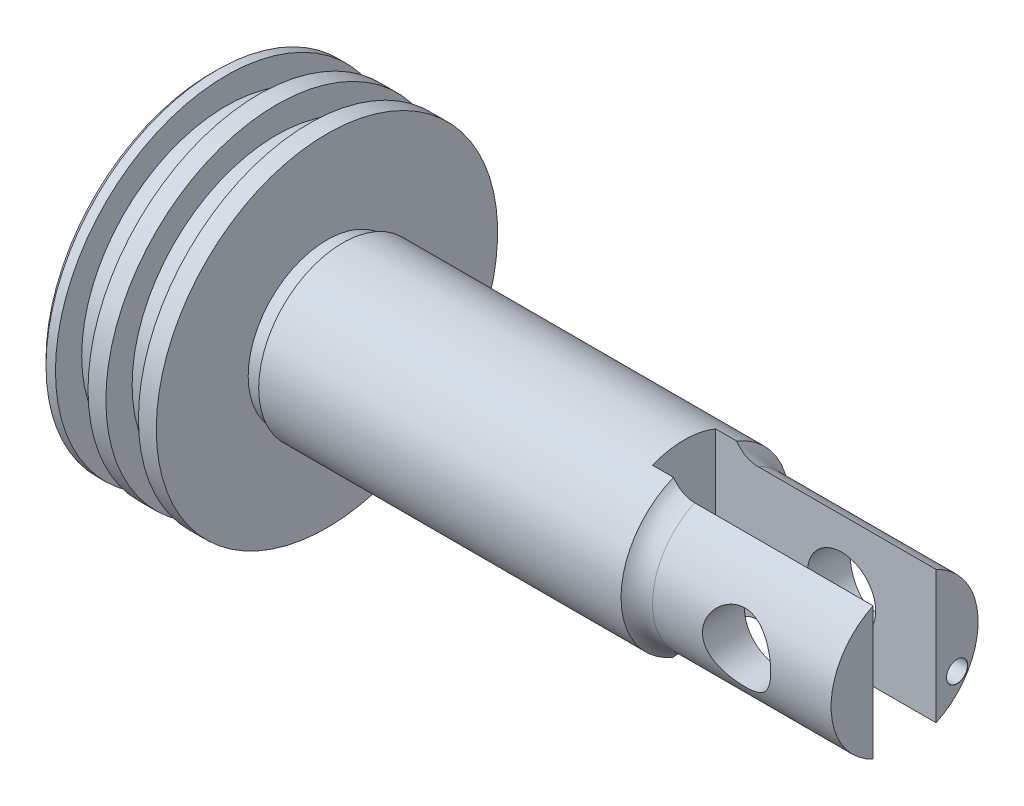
ISO-10303-21;
HEADER;
FILE_DESCRIPTION(('STEP AP214'),'2;1');
FILE_NAME('part.step','',(''),(''),'','','');
FILE_SCHEMA(('AUTOMOTIVE_DESIGN { 1 0 10303 214 1 1 1 1 }'));
ENDSEC;
DATA;
#1=APPLICATION_CONTEXT('core data for automotive mechanical design processes');
#2=APPLICATION_PROTOCOL_DEFINITION('international standard','automotive_design',2000,#1);
#3=PRODUCT_CONTEXT('',#1,'mechanical');
#4=PRODUCT('Part','Part','',(#3));
#5=PRODUCT_RELATED_PRODUCT_CATEGORY('part','',(#4));
#6=PRODUCT_DEFINITION_FORMATION('','',#4);
#7=PRODUCT_DEFINITION_CONTEXT('part definition',#1,'design');
#8=PRODUCT_DEFINITION('design','',#6,#7);
#9=PRODUCT_DEFINITION_SHAPE('','',#8);
#10=(LENGTH_UNIT() NAMED_UNIT(*) SI_UNIT(.MILLI.,.METRE.));
#11=(NAMED_UNIT(*) PLANE_ANGLE_UNIT() SI_UNIT($,.RADIAN.));
#12=(NAMED_UNIT(*) SI_UNIT($,.STERADIAN.) SOLID_ANGLE_UNIT());
#13=UNCERTAINTY_MEASURE_WITH_UNIT(LENGTH_MEASURE(1.E-05),#10,'distance_accuracy_value','');
#14=(GEOMETRIC_REPRESENTATION_CONTEXT(3) GLOBAL_UNCERTAINTY_ASSIGNED_CONTEXT((#13)) GLOBAL_UNIT_ASSIGNED_CONTEXT((#10,
#11,#12)) REPRESENTATION_CONTEXT('',''));
#15=CARTESIAN_POINT('',(0.,0.,0.));
#16=DIRECTION('',(0.,0.,1.));
#17=DIRECTION('',(1.,0.,0.));
#18=AXIS2_PLACEMENT_3D('',#15,#16,#17);
#19=CARTESIAN_POINT('',(132.,0.,0.));
#20=DIRECTION('',(-1.,0.,0.));
#21=DIRECTION('',(0.,0.,1.));
#22=AXIS2_PLACEMENT_3D('',#19,#20,#21);
#23=PLANE('',#22);
#24=CARTESIAN_POINT('',(132.,-6.17900694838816,-10.));
#25=DIRECTION('',(1.,0.,0.));
#26=DIRECTION('',(0.,0.,-1.));
#27=AXIS2_PLACEMENT_3D('',#24,#25,#26);
#28=CIRCLE('',#27,2.025);
#29=CARTESIAN_POINT('',(132.,-6.17900694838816,-12.025));
#30=VERTEX_POINT('',#29);
#31=EDGE_CURVE('E584',#30,#30,#28,.T.);
#32=ORIENTED_EDGE('',*,*,#31,.F.);
#33=EDGE_LOOP('',(#32));
#34=FACE_BOUND('',#33,.T.);
#35=CARTESIAN_POINT('',(132.,0.,0.));
#36=DIRECTION('',(-1.,0.,0.));
#37=DIRECTION('',(0.,0.,1.));
#38=AXIS2_PLACEMENT_3D('',#35,#36,#37);
#39=CIRCLE('',#38,14.);
#40=CARTESIAN_POINT('',(132.,12.6491106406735,-6.));
#41=VERTEX_POINT('',#40);
#42=CARTESIAN_POINT('',(132.,-12.6491106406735,-6.));
#43=VERTEX_POINT('',#42);
#44=EDGE_CURVE('E547',#41,#43,#39,.T.);
#45=ORIENTED_EDGE('',*,*,#44,.F.);
#46=DIRECTION('',(0.,1.,0.));
#47=VECTOR('',#46,1.);
#48=CARTESIAN_POINT('',(132.,-20.3710142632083,-6.));
#49=LINE('',#48,#47);
#50=EDGE_CURVE('E560',#43,#41,#49,.T.);
#51=ORIENTED_EDGE('',*,*,#50,.F.);
#52=EDGE_LOOP('',(#45,#51));
#53=FACE_BOUND('',#52,.T.);
#54=ADVANCED_FACE('F44',(#34,#53),#23,.F.);
#55=CARTESIAN_POINT('',(12.4,0.,0.));
#56=DIRECTION('',(-1.,0.,0.));
#57=DIRECTION('',(0.,0.,1.));
#58=AXIS2_PLACEMENT_3D('',#55,#56,#57);
#59=CYLINDRICAL_SURFACE('',#58,14.);
#60=DIRECTION('',(-1.,0.,0.));
#61=VECTOR('',#60,1.);
#62=CARTESIAN_POINT('',(12.4,-12.6491106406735,-6.));
#63=LINE('',#62,#61);
#64=CARTESIAN_POINT('',(98.,-12.6491106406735,-6.));
#65=VERTEX_POINT('',#64);
#66=EDGE_CURVE('E203',#65,#43,#63,.F.);
#67=ORIENTED_EDGE('',*,*,#66,.F.);
#68=CARTESIAN_POINT('',(98.,0.,0.));
#69=DIRECTION('',(-1.,0.,0.));
#70=DIRECTION('',(0.,0.,1.));
#71=AXIS2_PLACEMENT_3D('',#68,#69,#70);
#72=CIRCLE('',#71,14.);
#73=CARTESIAN_POINT('',(98.,12.6491106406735,-6.));
#74=VERTEX_POINT('',#73);
#75=EDGE_CURVE('E527',#74,#65,#72,.T.);
#76=ORIENTED_EDGE('',*,*,#75,.F.);
#77=DIRECTION('',(-1.,0.,0.));
#78=VECTOR('',#77,1.);
#79=CARTESIAN_POINT('',(12.4,12.6491106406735,-6.));
#80=LINE('',#79,#78);
#81=EDGE_CURVE('E483',#41,#74,#80,.T.);
#82=ORIENTED_EDGE('',*,*,#81,.F.);
#83=ORIENTED_EDGE('',*,*,#44,.T.);
#84=EDGE_LOOP('',(#67,#76,#82,#83));
#85=FACE_BOUND('',#84,.T.);
#86=CARTESIAN_POINT('',(120.5,0.,-14.));
#87=CARTESIAN_POINT('',(120.499998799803,-0.172368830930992,-13.9999989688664));
#88=CARTESIAN_POINT('',(120.493134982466,-0.344770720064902,-13.9968085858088));
#89=CARTESIAN_POINT('',(120.465750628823,-0.68832353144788,-13.9841262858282));
#90=CARTESIAN_POINT('',(120.445222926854,-0.85947374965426,-13.9746310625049));
#91=CARTESIAN_POINT('',(120.390693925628,-1.19946739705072,-13.9495656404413));
#92=CARTESIAN_POINT('',(120.356669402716,-1.36830632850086,-13.9339849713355));
#93=CARTESIAN_POINT('',(120.27550323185,-1.70223345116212,-13.8971448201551));
#94=CARTESIAN_POINT('',(120.228356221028,-1.86732007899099,-13.8758830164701));
#95=CARTESIAN_POINT('',(120.121651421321,-2.19190542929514,-13.8283168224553));
#96=CARTESIAN_POINT('',(120.062145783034,-2.35142444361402,-13.8020336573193));
#97=CARTESIAN_POINT('',(119.93112911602,-2.66468532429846,-13.7449923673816));
#98=CARTESIAN_POINT('',(119.859613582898,-2.81842499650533,-13.714232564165));
#99=CARTESIAN_POINT('',(119.705218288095,-3.11913879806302,-13.6489788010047));
#100=CARTESIAN_POINT('',(119.622345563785,-3.26611704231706,-13.6144871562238));
#101=CARTESIAN_POINT('',(119.445797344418,-3.55269609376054,-13.5425338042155));
#102=CARTESIAN_POINT('',(119.352117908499,-3.69229418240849,-13.5050710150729));
#103=CARTESIAN_POINT('',(119.045103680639,-4.113612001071,-13.3852980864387));
#104=CARTESIAN_POINT('',(118.81407458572,-4.38165701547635,-13.2992353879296));
#105=CARTESIAN_POINT('',(118.311797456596,-4.87676939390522,-13.1257819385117));
#106=CARTESIAN_POINT('',(118.040523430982,-5.10381006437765,-13.0383903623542));
#107=CARTESIAN_POINT('',(117.59841252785,-5.41635306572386,-12.9103420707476));
#108=CARTESIAN_POINT('',(117.43986206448,-5.51842549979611,-12.8669258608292));
#109=CARTESIAN_POINT('',(117.113820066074,-5.70874024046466,-12.7836248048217));
#110=CARTESIAN_POINT('',(116.94633232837,-5.79698835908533,-12.7437384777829));
#111=CARTESIAN_POINT('',(116.603396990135,-5.95888270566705,-12.6688468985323));
#112=CARTESIAN_POINT('',(116.427949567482,-6.03252925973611,-12.6338415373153));
#113=CARTESIAN_POINT('',(116.070354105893,-6.16440740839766,-12.5700219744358));
#114=CARTESIAN_POINT('',(115.888209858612,-6.22264757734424,-12.541204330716));
#115=CARTESIAN_POINT('',(115.52871735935,-6.32026752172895,-12.4922790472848));
#116=CARTESIAN_POINT('',(115.351656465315,-6.36050856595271,-12.471779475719));
#117=CARTESIAN_POINT('',(114.994186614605,-6.42608676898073,-12.4381177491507));
#118=CARTESIAN_POINT('',(114.813779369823,-6.45143134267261,-12.4249519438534));
#119=CARTESIAN_POINT('',(114.451148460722,-6.48688221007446,-12.4064806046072));
#120=CARTESIAN_POINT('',(114.268925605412,-6.49699500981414,-12.4011717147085));
#121=CARTESIAN_POINT('',(113.904225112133,-6.50185181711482,-12.3986262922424));
#122=CARTESIAN_POINT('',(113.721747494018,-6.49659696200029,-12.4013891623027));
#123=CARTESIAN_POINT('',(113.376355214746,-6.47209265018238,-12.4141925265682));
#124=CARTESIAN_POINT('',(113.213307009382,-6.4542934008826,-12.4234785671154));
#125=CARTESIAN_POINT('',(112.889423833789,-6.40651410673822,-12.4481846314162));
#126=CARTESIAN_POINT('',(112.728589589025,-6.37653016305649,-12.463606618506));
#127=CARTESIAN_POINT('',(112.410280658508,-6.30471333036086,-12.5000882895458));
#128=CARTESIAN_POINT('',(112.252805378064,-6.26288255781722,-12.5211469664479));
#129=CARTESIAN_POINT('',(111.942066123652,-6.16776493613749,-12.5682731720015));
#130=CARTESIAN_POINT('',(111.788803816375,-6.1144736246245,-12.5943426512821));
#131=CARTESIAN_POINT('',(111.483961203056,-5.99557437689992,-12.6513845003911));
#132=CARTESIAN_POINT('',(111.33249696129,-5.92971556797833,-12.6824542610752));
#133=CARTESIAN_POINT('',(111.035617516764,-5.78701885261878,-12.7481991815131));
#134=CARTESIAN_POINT('',(110.890204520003,-5.71017698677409,-12.7828756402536));
#135=CARTESIAN_POINT('',(110.464091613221,-5.46396515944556,-12.89097462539));
#136=CARTESIAN_POINT('',(110.193362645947,-5.27884798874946,-12.9684972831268));
#137=CARTESIAN_POINT('',(109.655960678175,-4.84872290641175,-13.1357709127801));
#138=CARTESIAN_POINT('',(109.39284250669,-4.59941916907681,-13.2259412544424));
#139=CARTESIAN_POINT('',(109.031487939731,-4.19484162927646,-13.3575277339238));
#140=CARTESIAN_POINT('',(108.916521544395,-4.05477019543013,-13.4008073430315));
#141=CARTESIAN_POINT('',(108.698401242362,-3.76508730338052,-13.4850593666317));
#142=CARTESIAN_POINT('',(108.595242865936,-3.61547948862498,-13.52603265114));
#143=CARTESIAN_POINT('',(108.398034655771,-3.30204192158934,-13.606013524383));
#144=CARTESIAN_POINT('',(108.30443795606,-3.13789588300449,-13.6448997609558));
#145=CARTESIAN_POINT('',(108.131567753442,-2.80129901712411,-13.717957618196));
#146=CARTESIAN_POINT('',(108.052288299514,-2.62885167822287,-13.752131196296));
#147=CARTESIAN_POINT('',(107.908848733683,-2.27683670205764,-13.8147732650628));
#148=CARTESIAN_POINT('',(107.844683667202,-2.0972714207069,-13.8432436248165));
#149=CARTESIAN_POINT('',(107.73219360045,-1.73235278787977,-13.8936267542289));
#150=CARTESIAN_POINT('',(107.683867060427,-1.54700000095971,-13.9155401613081));
#151=CARTESIAN_POINT('',(107.606667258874,-1.18607265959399,-13.9507568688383));
#152=CARTESIAN_POINT('',(107.576610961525,-1.01080128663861,-13.964580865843));
#153=CARTESIAN_POINT('',(107.530945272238,-0.657998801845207,-13.9856446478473));
#154=CARTESIAN_POINT('',(107.515334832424,-0.480467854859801,-13.9928849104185));
#155=CARTESIAN_POINT('',(107.498755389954,-0.124633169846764,-14.0005759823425));
#156=CARTESIAN_POINT('',(107.49778178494,0.0536703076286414,-14.0010289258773));
#157=CARTESIAN_POINT('',(107.510476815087,0.409638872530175,-13.9951376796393));
#158=CARTESIAN_POINT('',(107.524144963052,0.587303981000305,-13.9887937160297));
#159=CARTESIAN_POINT('',(107.564591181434,0.929072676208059,-13.9701177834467));
#160=CARTESIAN_POINT('',(107.590460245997,1.09330769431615,-13.9582014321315));
#161=CARTESIAN_POINT('',(107.654586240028,1.41889469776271,-13.9288715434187));
#162=CARTESIAN_POINT('',(107.692847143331,1.58024574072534,-13.9114562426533));
#163=CARTESIAN_POINT('',(107.781363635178,1.89892145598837,-13.8715492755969));
#164=CARTESIAN_POINT('',(107.831615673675,2.05624730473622,-13.8490591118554));
#165=CARTESIAN_POINT('',(107.943681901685,2.36604289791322,-13.799509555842));
#166=CARTESIAN_POINT('',(108.005500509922,2.51851076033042,-13.7724484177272));
#167=CARTESIAN_POINT('',(108.142227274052,2.82224459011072,-13.713481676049));
#168=CARTESIAN_POINT('',(108.217475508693,2.97333391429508,-13.6814540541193));
#169=CARTESIAN_POINT('',(108.379117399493,3.26864547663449,-13.6139245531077));
#170=CARTESIAN_POINT('',(108.46551514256,3.41286517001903,-13.5784214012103));
#171=CARTESIAN_POINT('',(108.740533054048,3.83410813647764,-13.4678768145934));
#172=CARTESIAN_POINT('',(108.945051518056,4.09987768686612,-13.3887674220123));
#173=CARTESIAN_POINT('',(109.411233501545,4.61789760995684,-13.219519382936));
#174=CARTESIAN_POINT('',(109.676321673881,4.86695733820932,-13.1290201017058));
#175=CARTESIAN_POINT('',(110.10278775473,5.20526443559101,-12.9969214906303));
#176=CARTESIAN_POINT('',(110.249871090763,5.31222065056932,-12.9534654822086));
#177=CARTESIAN_POINT('',(110.552953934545,5.51370528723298,-12.8689923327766));
#178=CARTESIAN_POINT('',(110.708949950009,5.60823852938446,-12.8279742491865));
#179=CARTESIAN_POINT('',(111.034177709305,5.78700535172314,-12.748351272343));
#180=CARTESIAN_POINT('',(111.203673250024,5.87081257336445,-12.7098655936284));
#181=CARTESIAN_POINT('',(111.550196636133,6.02364491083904,-12.638149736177));
#182=CARTESIAN_POINT('',(111.727221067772,6.09267664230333,-12.6049172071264));
#183=CARTESIAN_POINT('',(112.087519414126,6.21519087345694,-12.5449614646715));
#184=CARTESIAN_POINT('',(112.270789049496,6.26868379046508,-12.5182338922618));
#185=CARTESIAN_POINT('',(112.642221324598,6.3594789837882,-12.4723544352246));
#186=CARTESIAN_POINT('',(112.830383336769,6.39678332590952,-12.4532015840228));
#187=CARTESIAN_POINT('',(113.192900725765,6.45206443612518,-12.4246423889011));
#188=CARTESIAN_POINT('',(113.366981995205,6.47147384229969,-12.4145163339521));
#189=CARTESIAN_POINT('',(113.716410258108,6.49617167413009,-12.4016108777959));
#190=CARTESIAN_POINT('',(113.891757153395,6.50146118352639,-12.3988309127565));
#191=CARTESIAN_POINT('',(114.242221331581,6.49784840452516,-12.4007245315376));
#192=CARTESIAN_POINT('',(114.417338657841,6.48894936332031,-12.4053964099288));
#193=CARTESIAN_POINT('',(114.765935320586,6.45708719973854,-12.4220105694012));
#194=CARTESIAN_POINT('',(114.939414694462,6.43412439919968,-12.4339526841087));
#195=CARTESIAN_POINT('',(115.27100915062,6.37658137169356,-12.4635537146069));
#196=CARTESIAN_POINT('',(115.429333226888,6.34295339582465,-12.4807407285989));
#197=CARTESIAN_POINT('',(115.742450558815,6.26417901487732,-12.5204634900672));
#198=CARTESIAN_POINT('',(115.897242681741,6.21902896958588,-12.543000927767));
#199=CARTESIAN_POINT('',(116.202351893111,6.11763688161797,-12.5927639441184));
#200=CARTESIAN_POINT('',(116.352669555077,6.06139626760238,-12.6199889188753));
#201=CARTESIAN_POINT('',(116.648112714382,5.9382777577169,-12.678386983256));
#202=CARTESIAN_POINT('',(116.793236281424,5.87139595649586,-12.7095615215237));
#203=CARTESIAN_POINT('',(117.238444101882,5.64603376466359,-12.8121318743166));
#204=CARTESIAN_POINT('',(117.528298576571,5.46945765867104,-12.8891662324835));
#205=CARTESIAN_POINT('',(118.075993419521,5.07448578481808,-13.049709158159));
#206=CARTESIAN_POINT('',(118.333818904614,4.8560706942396,-13.1332207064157));
#207=CARTESIAN_POINT('',(118.704834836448,4.48874985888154,-13.2616081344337));
#208=CARTESIAN_POINT('',(118.830904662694,4.35278920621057,-13.3069603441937));
#209=CARTESIAN_POINT('',(119.071187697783,4.07030802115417,-13.396062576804));
#210=CARTESIAN_POINT('',(119.18540492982,3.923791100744,-13.4398131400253));
#211=CARTESIAN_POINT('',(119.401311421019,3.62083857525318,-13.5245812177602));
#212=CARTESIAN_POINT('',(119.502988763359,3.46439374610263,-13.5655961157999));
#213=CARTESIAN_POINT('',(119.692842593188,3.14267521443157,-13.6437155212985));
#214=CARTESIAN_POINT('',(119.781025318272,2.97740563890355,-13.6808218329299));
#215=CARTESIAN_POINT('',(119.942684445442,2.63994520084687,-13.7499158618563));
#216=CARTESIAN_POINT('',(120.016239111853,2.4677974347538,-13.7819306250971));
#217=CARTESIAN_POINT('',(120.148446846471,2.11700523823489,-13.8401544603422));
#218=CARTESIAN_POINT('',(120.207107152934,1.93836401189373,-13.866366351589));
#219=CARTESIAN_POINT('',(120.308766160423,1.57630743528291,-13.9121700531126));
#220=CARTESIAN_POINT('',(120.351801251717,1.39290425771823,-13.9317772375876));
#221=CARTESIAN_POINT('',(120.421829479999,1.0225373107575,-13.96384324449));
#222=CARTESIAN_POINT('',(120.448833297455,0.835575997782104,-13.9763068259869));
#223=CARTESIAN_POINT('',(120.478420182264,0.540150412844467,-13.9899910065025));
#224=CARTESIAN_POINT('',(120.486508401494,0.432321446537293,-13.9937403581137));
#225=CARTESIAN_POINT('',(120.497298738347,0.216332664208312,-13.9987452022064));
#226=CARTESIAN_POINT('',(120.500000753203,0.108172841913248,-14.0000006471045));
#227=CARTESIAN_POINT('',(120.5,0.,-14.));
#228=B_SPLINE_CURVE_WITH_KNOTS('',3,(#86,#87,#88,#89,#90,#91,#92,#93,#94,#95,#96,#97,#98,#99,
#100,#101,#102,#103,#104,#105,#106,#107,#108,#109,#110,#111,#112,#113,#114,#115,#116,#117,#118,
#119,#120,#121,#122,#123,#124,#125,#126,#127,#128,#129,#130,#131,#132,#133,#134,#135,#136,#137,
#138,#139,#140,#141,#142,#143,#144,#145,#146,#147,#148,#149,#150,#151,#152,#153,#154,#155,#156,
#157,#158,#159,#160,#161,#162,#163,#164,#165,#166,#167,#168,#169,#170,#171,#172,#173,#174,#175,
#176,#177,#178,#179,#180,#181,#182,#183,#184,#185,#186,#187,#188,#189,#190,#191,#192,#193,#194,
#195,#196,#197,#198,#199,#200,#201,#202,#203,#204,#205,#206,#207,#208,#209,#210,#211,#212,#213,
#214,#215,#216,#217,#218,#219,#220,#221,#222,#223,#224,#225,#226,#227),.UNSPECIFIED.,.T.,.F.,(4,
2,2,2,2,2,2,2,2,2,2,2,2,2,2,2,2,2,2,2,2,2,2,2,2,2,2,2,2,2,2,2,2,2,2,2,2,2,2,2,2,2,2,2,2,2,2,2,2,
2,2,2,2,2,2,2,2,2,2,2,2,2,2,2,2,2,2,2,2,2,4),(0.,0.516998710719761,1.03426876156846,
1.55243275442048,2.07080882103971,2.58704035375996,3.10346593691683,3.61957295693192,
4.13586878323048,5.22349692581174,6.31183057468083,6.89170836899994,7.47134171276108,
8.0509621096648,8.63025923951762,9.17768927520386,9.7248465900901,10.2717701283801,
10.8186531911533,11.3109134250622,11.8033312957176,12.2956612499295,12.7881832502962,
13.2918231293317,13.795645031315,14.8027858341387,15.918035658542,16.4764414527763,
17.0346351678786,17.6126371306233,18.1903982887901,18.7679697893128,19.3454851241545,
19.87988166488,20.414239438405,20.9484291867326,21.4826011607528,21.9820837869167,
22.4817267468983,22.9812219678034,23.4809083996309,23.995747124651,24.510775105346,
25.5402931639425,26.6594286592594,27.2198458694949,27.7800449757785,28.3581693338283,
28.9360342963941,29.5135109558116,30.0909139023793,30.6165645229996,31.1421747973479,
31.6676647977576,32.1931427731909,32.6809005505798,33.1688126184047,33.6566618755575,
34.1446905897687,35.1842681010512,36.2243268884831,36.7963981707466,37.368274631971,
37.9406904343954,38.5128408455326,39.0818424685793,39.6505670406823,40.2179584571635,
40.784971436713,41.1094161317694,41.4338670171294),.UNSPECIFIED.);
#229=CARTESIAN_POINT('',(120.5,0.,-14.));
#230=VERTEX_POINT('',#229);
#231=EDGE_CURVE('E193',#230,#230,#228,.T.);
#232=ORIENTED_EDGE('',*,*,#231,.F.);
#233=EDGE_LOOP('',(#232));
#234=FACE_BOUND('',#233,.T.);
#235=ADVANCED_FACE('F132',(#85,#234),#59,.T.);
#236=CARTESIAN_POINT('',(98.,0.,0.));
#237=DIRECTION('',(-1.,0.,0.));
#238=DIRECTION('',(0.,0.,1.));
#239=AXIS2_PLACEMENT_3D('',#236,#237,#238);
#240=TOROIDAL_SURFACE('',#239,19.,5.);
#241=CARTESIAN_POINT('',(95.608409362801,-13.3200913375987,-6.));
#242=CARTESIAN_POINT('',(95.8334390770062,-13.1856718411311,-6.));
#243=CARTESIAN_POINT('',(96.0692505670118,-13.069116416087,-6.));
#244=CARTESIAN_POINT('',(96.5570012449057,-12.876525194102,-6.));
#245=CARTESIAN_POINT('',(96.8089432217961,-12.8004964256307,-6.));
#246=CARTESIAN_POINT('',(97.3227156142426,-12.6924786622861,-6.));
#247=CARTESIAN_POINT('',(97.5845653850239,-12.6605809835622,-6.));
#248=CARTESIAN_POINT('',(98.1097932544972,-12.6428110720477,-6.));
#249=CARTESIAN_POINT('',(98.3731710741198,-12.6569306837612,-6.));
#250=CARTESIAN_POINT('',(98.8856632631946,-12.7293045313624,-6.));
#251=CARTESIAN_POINT('',(99.1349685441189,-12.7862234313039,-6.));
#252=CARTESIAN_POINT('',(99.6209226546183,-12.9399434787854,-6.));
#253=CARTESIAN_POINT('',(99.8575695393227,-13.0367507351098,-6.));
#254=CARTESIAN_POINT('',(100.319350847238,-13.269632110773,-6.));
#255=CARTESIAN_POINT('',(100.543944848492,-13.4067735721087,-6.));
#256=CARTESIAN_POINT('',(100.969231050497,-13.7140734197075,-6.));
#257=CARTESIAN_POINT('',(101.169915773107,-13.8842420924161,-6.));
#258=CARTESIAN_POINT('',(101.559240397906,-14.2676686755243,-6.));
#259=CARTESIAN_POINT('',(101.745519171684,-14.4833237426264,-6.));
#260=CARTESIAN_POINT('',(102.082370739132,-14.9409153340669,-6.));
#261=CARTESIAN_POINT('',(102.232930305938,-15.182861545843,-6.));
#262=CARTESIAN_POINT('',(102.50567972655,-15.706298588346,-6.));
#263=CARTESIAN_POINT('',(102.624786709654,-15.9894001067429,-6.));
#264=CARTESIAN_POINT('',(102.815537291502,-16.5711926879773,-6.));
#265=CARTESIAN_POINT('',(102.88717040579,-16.8698871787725,-6.));
#266=CARTESIAN_POINT('',(102.982429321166,-17.4849518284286,-6.));
#267=CARTESIAN_POINT('',(103.004401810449,-17.8015803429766,-6.));
#268=CARTESIAN_POINT('',(102.994137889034,-18.4339954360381,-6.));
#269=CARTESIAN_POINT('',(102.961902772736,-18.749782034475,-6.));
#270=CARTESIAN_POINT('',(102.843949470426,-19.3668361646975,-6.));
#271=CARTESIAN_POINT('',(102.758958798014,-19.6682421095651,-6.));
#272=CARTESIAN_POINT('',(102.537547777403,-20.2515654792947,-6.));
#273=CARTESIAN_POINT('',(102.401137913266,-20.5334868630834,-6.));
#274=CARTESIAN_POINT('',(102.086312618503,-21.058027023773,-6.));
#275=CARTESIAN_POINT('',(101.909730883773,-21.3017458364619,-6.));
#276=CARTESIAN_POINT('',(101.516493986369,-21.7543917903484,-6.));
#277=CARTESIAN_POINT('',(101.299848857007,-21.9633276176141,-6.));
#278=CARTESIAN_POINT('',(100.842564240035,-22.3311587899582,-6.));
#279=CARTESIAN_POINT('',(100.603323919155,-22.4917943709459,-6.));
#280=CARTESIAN_POINT('',(100.100559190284,-22.7690356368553,-6.));
#281=CARTESIAN_POINT('',(99.8370397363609,-22.8856502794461,-6.));
#282=CARTESIAN_POINT('',(99.3024677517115,-23.0677800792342,-6.));
#283=CARTESIAN_POINT('',(99.0319382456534,-23.1348325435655,-6.));
#284=CARTESIAN_POINT('',(98.4834045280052,-23.2216908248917,-6.));
#285=CARTESIAN_POINT('',(98.2054012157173,-23.2415023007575,-6.));
#286=CARTESIAN_POINT('',(97.6548636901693,-23.2332906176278,-6.));
#287=CARTESIAN_POINT('',(97.3823170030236,-23.2060767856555,-6.));
#288=CARTESIAN_POINT('',(96.8456803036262,-23.1062635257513,-6.));
#289=CARTESIAN_POINT('',(96.5815900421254,-23.0336654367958,-6.));
#290=CARTESIAN_POINT('',(96.0692397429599,-22.8454284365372,-6.));
#291=CARTESIAN_POINT('',(95.8209800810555,-22.7297885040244,-6.));
#292=CARTESIAN_POINT('',(95.3469788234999,-22.4591178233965,-6.));
#293=CARTESIAN_POINT('',(95.121238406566,-22.3040850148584,-6.));
#294=CARTESIAN_POINT('',(94.6945409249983,-21.9564910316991,-6.));
#295=CARTESIAN_POINT('',(94.4940546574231,-21.7633524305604,-6.));
#296=CARTESIAN_POINT('',(94.127195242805,-21.3470460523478,-6.));
#297=CARTESIAN_POINT('',(93.9608263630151,-21.1238745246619,-6.));
#298=CARTESIAN_POINT('',(93.6613413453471,-20.6466263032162,-6.));
#299=CARTESIAN_POINT('',(93.5294026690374,-20.3918112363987,-6.));
#300=CARTESIAN_POINT('',(93.3083169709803,-19.8642701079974,-6.));
#301=CARTESIAN_POINT('',(93.2191778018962,-19.5915407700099,-6.));
#302=CARTESIAN_POINT('',(93.082405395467,-19.0242833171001,-6.));
#303=CARTESIAN_POINT('',(93.0365792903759,-18.7293196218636,-6.));
#304=CARTESIAN_POINT('',(92.9930401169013,-18.1358796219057,-6.));
#305=CARTESIAN_POINT('',(92.9953354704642,-17.8374027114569,-6.));
#306=CARTESIAN_POINT('',(93.0483344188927,-17.2327806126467,-6.));
#307=CARTESIAN_POINT('',(93.1009621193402,-16.926803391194,-6.));
#308=CARTESIAN_POINT('',(93.2556755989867,-16.327498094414,-6.));
#309=CARTESIAN_POINT('',(93.3577830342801,-16.0341756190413,-6.));
#310=CARTESIAN_POINT('',(93.6117148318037,-15.4619049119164,-6.));
#311=CARTESIAN_POINT('',(93.7646098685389,-15.1834308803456,-6.));
#312=CARTESIAN_POINT('',(94.1158091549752,-14.6569520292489,-6.));
#313=CARTESIAN_POINT('',(94.3140656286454,-14.4089155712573,-6.));
#314=CARTESIAN_POINT('',(94.6918658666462,-14.0140413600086,-6.));
#315=CARTESIAN_POINT('',(94.8618891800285,-13.8580066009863,-6.));
#316=CARTESIAN_POINT('',(95.2213068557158,-13.5700854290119,-6.));
#317=CARTESIAN_POINT('',(95.4106966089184,-13.4381932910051,-6.));
#318=CARTESIAN_POINT('',(95.608409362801,-13.3200913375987,-6.));
#319=B_SPLINE_CURVE_WITH_KNOTS('',3,(#241,#242,#243,#244,#245,#246,#247,#248,#249,#250,#251,
#252,#253,#254,#255,#256,#257,#258,#259,#260,#261,#262,#263,#264,#265,#266,#267,#268,#269,#270,
#271,#272,#273,#274,#275,#276,#277,#278,#279,#280,#281,#282,#283,#284,#285,#286,#287,#288,#289,
#290,#291,#292,#293,#294,#295,#296,#297,#298,#299,#300,#301,#302,#303,#304,#305,#306,#307,#308,
#309,#310,#311,#312,#313,#314,#315,#316,#317,#318),.UNSPECIFIED.,.T.,.F.,(4,2,2,2,2,2,2,2,2,2,2,
2,2,2,2,2,2,2,2,2,2,2,2,2,2,2,2,2,2,2,2,2,2,2,2,2,2,2,4),(0.,0.785612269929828,1.5713607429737,
2.35873266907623,3.14596505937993,3.90960516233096,4.67336225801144,5.45949586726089,
6.24587471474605,7.0971562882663,7.94875260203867,8.86601653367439,9.78348297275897,
10.7310702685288,11.6786349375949,12.6134141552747,13.548002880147,14.4463558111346,
15.3444840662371,16.2046944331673,17.0647296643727,17.8968187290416,18.7288081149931,
19.5466208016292,20.3644093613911,21.1822173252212,22.0000680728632,22.8314238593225,
23.6628835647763,24.5198652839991,25.3770041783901,26.2685039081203,27.1601596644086,
28.0873235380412,29.014893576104,29.9634107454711,30.9109334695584,31.6013420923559,
32.2915867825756),.UNSPECIFIED.);
#320=CARTESIAN_POINT('',(94.,-14.8323969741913,-6.));
#321=VERTEX_POINT('',#320);
#322=EDGE_CURVE('E490',#321,#65,#319,.T.);
#323=ORIENTED_EDGE('',*,*,#322,.F.);
#324=CARTESIAN_POINT('',(94.,0.,0.));
#325=DIRECTION('',(-1.,0.,0.));
#326=DIRECTION('',(0.,0.,1.));
#327=AXIS2_PLACEMENT_3D('',#324,#325,#326);
#328=CIRCLE('',#327,16.);
#329=CARTESIAN_POINT('',(94.,14.8323969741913,-6.));
#330=VERTEX_POINT('',#329);
#331=EDGE_CURVE('E522',#330,#321,#328,.T.);
#332=ORIENTED_EDGE('',*,*,#331,.F.);
#333=CARTESIAN_POINT('',(96.8625822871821,12.794049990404,-6.));
#334=CARTESIAN_POINT('',(96.7284795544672,12.8286517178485,-6.));
#335=CARTESIAN_POINT('',(96.5959300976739,12.869287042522,-6.));
#336=CARTESIAN_POINT('',(96.3348847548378,12.9621066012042,-6.));
#337=CARTESIAN_POINT('',(96.2063907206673,13.0142960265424,-6.));
#338=CARTESIAN_POINT('',(95.9541895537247,13.1296777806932,-6.));
#339=CARTESIAN_POINT('',(95.8304904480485,13.1928876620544,-6.));
#340=CARTESIAN_POINT('',(95.5888617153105,13.3295437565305,-6.));
#341=CARTESIAN_POINT('',(95.4709345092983,13.402994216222,-6.));
#342=CARTESIAN_POINT('',(95.1279498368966,13.6368922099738,-6.));
#343=CARTESIAN_POINT('',(94.9123474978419,13.811508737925,-6.));
#344=CARTESIAN_POINT('',(94.5114601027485,14.192193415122,-6.));
#345=CARTESIAN_POINT('',(94.3261675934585,14.3982538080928,-6.));
#346=CARTESIAN_POINT('',(93.9779595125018,14.8503448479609,-6.));
#347=CARTESIAN_POINT('',(93.8172837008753,15.0981036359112,-6.));
#348=CARTESIAN_POINT('',(93.5369698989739,15.6158624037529,-6.));
#349=CARTESIAN_POINT('',(93.4173470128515,15.8858705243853,-6.));
#350=CARTESIAN_POINT('',(93.2157149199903,16.458279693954,-6.));
#351=CARTESIAN_POINT('',(93.1364509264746,16.761651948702,-6.));
#352=CARTESIAN_POINT('',(93.0293360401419,17.3773773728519,-6.));
#353=CARTESIAN_POINT('',(93.0014914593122,17.6897316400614,-6.));
#354=CARTESIAN_POINT('',(92.9986103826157,18.3181013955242,-6.));
#355=CARTESIAN_POINT('',(93.0241441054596,18.6341201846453,-6.));
#356=CARTESIAN_POINT('',(93.1294485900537,19.2570233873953,-6.));
#357=CARTESIAN_POINT('',(93.2092125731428,19.563908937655,-6.));
#358=CARTESIAN_POINT('',(93.4187492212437,20.1505743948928,-6.));
#359=CARTESIAN_POINT('',(93.5470774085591,20.4308692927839,-6.));
#360=CARTESIAN_POINT('',(93.8509927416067,20.9645770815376,-6.));
#361=CARTESIAN_POINT('',(94.0265686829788,21.217996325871,-6.));
#362=CARTESIAN_POINT('',(94.4119595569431,21.6792117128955,-6.));
#363=CARTESIAN_POINT('',(94.6200013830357,21.8884894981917,-6.));
#364=CARTESIAN_POINT('',(95.0695148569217,22.267402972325,-6.));
#365=CARTESIAN_POINT('',(95.3109785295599,22.4370480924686,-6.));
#366=CARTESIAN_POINT('',(95.8102448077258,22.7250084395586,-6.));
#367=CARTESIAN_POINT('',(96.0670415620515,22.8450689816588,-6.));
#368=CARTESIAN_POINT('',(96.5975058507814,23.0390531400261,-6.));
#369=CARTESIAN_POINT('',(96.8711705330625,23.1129845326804,-6.));
#370=CARTESIAN_POINT('',(97.419907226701,23.210875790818,-6.));
#371=CARTESIAN_POINT('',(97.6947562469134,23.2360890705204,-6.));
#372=CARTESIAN_POINT('',(98.244737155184,23.2395220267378,-6.));
#373=CARTESIAN_POINT('',(98.5198690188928,23.2177454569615,-6.));
#374=CARTESIAN_POINT('',(99.059854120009,23.1283611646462,-6.));
#375=CARTESIAN_POINT('',(99.3247805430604,23.0611941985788,-6.));
#376=CARTESIAN_POINT('',(99.8397173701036,22.883653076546,-6.));
#377=CARTESIAN_POINT('',(100.089727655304,22.7732785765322,-6.));
#378=CARTESIAN_POINT('',(100.569869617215,22.5118258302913,-6.));
#379=CARTESIAN_POINT('',(100.799839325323,22.3604504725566,-6.));
#380=CARTESIAN_POINT('',(101.231825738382,22.0220533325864,-6.));
#381=CARTESIAN_POINT('',(101.433840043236,21.8350284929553,-6.));
#382=CARTESIAN_POINT('',(101.809334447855,21.4261702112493,-6.));
#383=CARTESIAN_POINT('',(101.98204549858,21.2036310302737,-6.));
#384=CARTESIAN_POINT('',(102.289150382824,20.7335488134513,-6.));
#385=CARTESIAN_POINT('',(102.423538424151,20.4860020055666,-6.));
#386=CARTESIAN_POINT('',(102.655382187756,19.9635862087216,-6.));
#387=CARTESIAN_POINT('',(102.751351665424,19.6880580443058,-6.));
#388=CARTESIAN_POINT('',(102.897714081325,19.1251681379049,-6.));
#389=CARTESIAN_POINT('',(102.948098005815,18.8378040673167,-6.));
#390=CARTESIAN_POINT('',(103.004001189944,18.2466853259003,-6.));
#391=CARTESIAN_POINT('',(103.007568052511,17.9427459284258,-6.));
#392=CARTESIAN_POINT('',(102.965453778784,17.3382789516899,-6.));
#393=CARTESIAN_POINT('',(102.919761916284,17.0377521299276,-6.));
#394=CARTESIAN_POINT('',(102.77831290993,16.4376613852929,-6.));
#395=CARTESIAN_POINT('',(102.680866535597,16.1384959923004,-6.));
#396=CARTESIAN_POINT('',(102.437382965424,15.5603581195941,-6.));
#397=CARTESIAN_POINT('',(102.291336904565,15.2813893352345,-6.));
#398=CARTESIAN_POINT('',(102.038076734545,14.8838452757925,-6.));
#399=CARTESIAN_POINT('',(101.947554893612,14.7543711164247,-6.));
#400=CARTESIAN_POINT('',(101.755626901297,14.5037835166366,-6.));
#401=CARTESIAN_POINT('',(101.654225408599,14.3826665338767,-6.));
#402=CARTESIAN_POINT('',(101.441077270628,14.1498361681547,-6.));
#403=CARTESIAN_POINT('',(101.329327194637,14.0381259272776,-6.));
#404=CARTESIAN_POINT('',(101.09623478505,13.8253061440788,-6.));
#405=CARTESIAN_POINT('',(100.974897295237,13.724191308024,-6.));
#406=CARTESIAN_POINT('',(100.729112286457,13.5379737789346,-6.));
#407=CARTESIAN_POINT('',(100.605058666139,13.4523512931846,-6.));
#408=CARTESIAN_POINT('',(100.349752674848,13.2927348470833,-6.));
#409=CARTESIAN_POINT('',(100.218503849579,13.2187352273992,-6.));
#410=CARTESIAN_POINT('',(99.9497006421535,13.0832523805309,-6.));
#411=CARTESIAN_POINT('',(99.8121467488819,13.0217681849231,-6.));
#412=CARTESIAN_POINT('',(99.53181475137,12.912169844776,-6.));
#413=CARTESIAN_POINT('',(99.3890372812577,12.8640540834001,-6.));
#414=CARTESIAN_POINT('',(99.1123655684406,12.7855691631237,-6.));
#415=CARTESIAN_POINT('',(98.9788101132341,12.7540025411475,-6.));
#416=CARTESIAN_POINT('',(98.7094090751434,12.7029910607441,-6.));
#417=CARTESIAN_POINT('',(98.5735637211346,12.6835449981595,-6.));
#418=CARTESIAN_POINT('',(98.3008969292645,12.6570683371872,-6.));
#419=CARTESIAN_POINT('',(98.1640775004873,12.6500170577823,-6.));
#420=CARTESIAN_POINT('',(97.8904164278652,12.6483685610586,-6.));
#421=CARTESIAN_POINT('',(97.7535748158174,12.6537662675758,-6.));
#422=CARTESIAN_POINT('',(97.4899649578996,12.6761595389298,-6.));
#423=CARTESIAN_POINT('',(97.3631288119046,12.6923648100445,-6.));
#424=CARTESIAN_POINT('',(97.111282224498,12.7353533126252,-6.));
#425=CARTESIAN_POINT('',(96.9862715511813,12.7621351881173,-6.));
#426=CARTESIAN_POINT('',(96.8625822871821,12.794049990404,-6.));
#427=B_SPLINE_CURVE_WITH_KNOTS('',3,(#333,#334,#335,#336,#337,#338,#339,#340,#341,#342,#343,
#344,#345,#346,#347,#348,#349,#350,#351,#352,#353,#354,#355,#356,#357,#358,#359,#360,#361,#362,
#363,#364,#365,#366,#367,#368,#369,#370,#371,#372,#373,#374,#375,#376,#377,#378,#379,#380,#381,
#382,#383,#384,#385,#386,#387,#388,#389,#390,#391,#392,#393,#394,#395,#396,#397,#398,#399,#400,
#401,#402,#403,#404,#405,#406,#407,#408,#409,#410,#411,#412,#413,#414,#415,#416,#417,#418,#419,
#420,#421,#422,#423,#424,#425,#426),.UNSPECIFIED.,.T.,.F.,(4,2,2,2,2,2,2,2,2,2,2,2,2,2,2,2,2,2,
2,2,2,2,2,2,2,2,2,2,2,2,2,2,2,2,2,2,2,2,2,2,2,2,2,2,2,2,4),(0.,0.415355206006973,
0.830897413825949,1.24710761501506,1.6634909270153,2.49187491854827,3.32005490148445,
4.20210932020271,5.08448791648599,6.02078727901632,6.95720156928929,7.90367028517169,
8.85002071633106,9.77019140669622,10.6901440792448,11.5709835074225,12.4516131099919,
13.2978639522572,14.143972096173,14.9680056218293,15.7919733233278,16.6080528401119,
17.4241388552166,18.2463045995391,19.0685408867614,19.9098166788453,20.7512195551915,
21.6225969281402,22.4941465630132,23.4019319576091,24.3099150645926,25.2495403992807,
26.1893372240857,26.6627888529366,27.1360385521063,27.6094457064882,28.0826151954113,
28.5342156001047,28.9855954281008,29.4369403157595,29.8882305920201,30.2993982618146,
30.710525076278,31.1209652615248,31.5312381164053,31.9143888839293,32.2974905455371),.UNSPECIFIED.);
#428=EDGE_CURVE('E480',#74,#330,#427,.T.);
#429=ORIENTED_EDGE('',*,*,#428,.F.);
#430=ORIENTED_EDGE('',*,*,#75,.T.);
#431=EDGE_LOOP('',(#323,#332,#429,#430));
#432=FACE_BOUND('',#431,.T.);
#433=ADVANCED_FACE('F145',(#432),#240,.F.);
#434=CARTESIAN_POINT('',(114.,0.,-55.5));
#435=DIRECTION('',(0.,0.,1.));
#436=DIRECTION('',(1.,0.,0.));
#437=AXIS2_PLACEMENT_3D('',#434,#435,#436);
#438=CYLINDRICAL_SURFACE('',#437,6.5);
#439=CARTESIAN_POINT('',(118.120372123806,-5.0271794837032,-8.12523116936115));
#440=CARTESIAN_POINT('',(118.083021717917,-5.05779152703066,-8.17938007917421));
#441=CARTESIAN_POINT('',(118.045687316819,-5.08769658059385,-8.2339339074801));
#442=CARTESIAN_POINT('',(117.971076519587,-5.14614422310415,-8.34380591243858));
#443=CARTESIAN_POINT('',(117.933800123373,-5.17468681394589,-8.39912408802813));
#444=CARTESIAN_POINT('',(117.82190280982,-5.25849356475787,-8.56644717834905));
#445=CARTESIAN_POINT('',(117.747408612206,-5.31177775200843,-8.67953810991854));
#446=CARTESIAN_POINT('',(117.623472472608,-5.3966753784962,-8.87116622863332));
#447=CARTESIAN_POINT('',(117.573788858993,-5.42968597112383,-8.94893506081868));
#448=CARTESIAN_POINT('',(117.475256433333,-5.49326969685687,-9.10577127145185));
#449=CARTESIAN_POINT('',(117.42640623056,-5.52384728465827,-9.1848359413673));
#450=CARTESIAN_POINT('',(117.347243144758,-5.57201035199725,-9.31689597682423));
#451=CARTESIAN_POINT('',(117.316438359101,-5.59039086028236,-9.36930772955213));
#452=CARTESIAN_POINT('',(117.25602575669,-5.62579010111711,-9.47562395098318));
#453=CARTESIAN_POINT('',(117.226423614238,-5.64280268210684,-9.52953383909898));
#454=CARTESIAN_POINT('',(117.186380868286,-5.66543640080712,-9.60803721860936));
#455=CARTESIAN_POINT('',(117.174686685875,-5.67199541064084,-9.63171400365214));
#456=CARTESIAN_POINT('',(117.152161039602,-5.68454446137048,-9.67961775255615));
#457=CARTESIAN_POINT('',(117.141329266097,-5.69053470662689,-9.70384451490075));
#458=CARTESIAN_POINT('',(117.121039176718,-5.70168814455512,-9.75290305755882));
#459=CARTESIAN_POINT('',(117.111573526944,-5.70685577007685,-9.77773070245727));
#460=CARTESIAN_POINT('',(117.094708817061,-5.71601862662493,-9.82826832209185));
#461=CARTESIAN_POINT('',(117.08730637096,-5.72001577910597,-9.85397677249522));
#462=CARTESIAN_POINT('',(117.0749022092,-5.72669496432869,-9.90986393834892));
#463=CARTESIAN_POINT('',(117.070348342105,-5.72913268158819,-9.94018373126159));
#464=CARTESIAN_POINT('',(117.066861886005,-5.73100041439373,-10.0011202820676));
#465=CARTESIAN_POINT('',(117.067900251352,-5.73044597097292,-10.0317346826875));
#466=CARTESIAN_POINT('',(117.075937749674,-5.72613522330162,-10.0989565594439));
#467=CARTESIAN_POINT('',(117.084237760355,-5.72167997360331,-10.1353450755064));
#468=CARTESIAN_POINT('',(117.100175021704,-5.71305103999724,-10.1886330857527));
#469=CARTESIAN_POINT('',(117.106116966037,-5.70982397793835,-10.2062861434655));
#470=CARTESIAN_POINT('',(117.118865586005,-5.70287036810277,-10.2411791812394));
#471=CARTESIAN_POINT('',(117.12567203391,-5.69914395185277,-10.2584192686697));
#472=CARTESIAN_POINT('',(117.148046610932,-5.68683590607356,-10.3120848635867));
#473=CARTESIAN_POINT('',(117.164725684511,-5.67757927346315,-10.3478821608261));
#474=CARTESIAN_POINT('',(117.199575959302,-5.65801354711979,-10.4184576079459));
#475=CARTESIAN_POINT('',(117.217748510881,-5.647703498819,-10.4532347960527));
#476=CARTESIAN_POINT('',(117.255004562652,-5.62631387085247,-10.5221619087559));
#477=CARTESIAN_POINT('',(117.274090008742,-5.61523262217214,-10.5563102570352));
#478=CARTESIAN_POINT('',(117.312805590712,-5.5924792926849,-10.6240991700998));
#479=CARTESIAN_POINT('',(117.332435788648,-5.58080714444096,-10.6577396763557));
#480=CARTESIAN_POINT('',(117.391843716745,-5.54504538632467,-10.7580682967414));
#481=CARTESIAN_POINT('',(117.432146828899,-5.52020586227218,-10.824177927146));
#482=CARTESIAN_POINT('',(117.513369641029,-5.4688705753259,-10.9552140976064));
#483=CARTESIAN_POINT('',(117.554288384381,-5.44237721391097,-11.020142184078));
#484=CARTESIAN_POINT('',(117.638842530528,-5.38623652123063,-11.1527250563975));
#485=CARTESIAN_POINT('',(117.682500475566,-5.35649553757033,-11.2203258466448));
#486=CARTESIAN_POINT('',(117.770087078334,-5.29521506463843,-11.3545834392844));
#487=CARTESIAN_POINT('',(117.814015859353,-5.26367469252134,-11.4212397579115));
#488=CARTESIAN_POINT('',(117.90164848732,-5.19904598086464,-11.5529968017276));
#489=CARTESIAN_POINT('',(117.94535106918,-5.16597309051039,-11.6181059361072));
#490=CARTESIAN_POINT('',(118.032821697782,-5.09798127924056,-11.7472501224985));
#491=CARTESIAN_POINT('',(118.076589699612,-5.06306331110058,-11.8112857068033));
#492=CARTESIAN_POINT('',(118.120372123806,-5.0271794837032,-11.8747688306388));
#493=B_SPLINE_CURVE_WITH_KNOTS('',3,(#439,#440,#441,#442,#443,#444,#445,#446,#447,#448,#449,
#450,#451,#452,#453,#454,#455,#456,#457,#458,#459,#460,#461,#462,#463,#464,#465,#466,#467,#468,
#469,#470,#471,#472,#473,#474,#475,#476,#477,#478,#479,#480,#481,#482,#483,#484,#485,#486,#487,
#488,#489,#490,#491,#492),.UNSPECIFIED.,.F.,.F.,(4,2,2,2,2,2,2,2,2,2,2,2,2,2,2,2,2,2,2,2,2,2,2,
2,2,2,4),(0.,0.217653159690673,0.435306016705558,0.871745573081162,1.16574978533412,
1.459202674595,1.64972251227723,1.84105607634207,1.92266821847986,2.00425092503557,
2.08537792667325,2.16637099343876,2.25809179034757,2.34933665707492,2.4613155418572,
2.51801834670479,2.57470624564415,2.69628315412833,2.81797122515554,2.93993137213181,
3.06190546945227,3.30580228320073,3.54935282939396,3.80670548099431,4.06418550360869,
4.31947538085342,4.57463469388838),.UNSPECIFIED.);
#494=CARTESIAN_POINT('',(118.,-5.1234753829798,-8.30122011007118));
#495=VERTEX_POINT('',#494);
#496=CARTESIAN_POINT('',(118.,-5.12347538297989,-11.6987798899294));
#497=VERTEX_POINT('',#496);
#498=EDGE_CURVE('E225',#495,#497,#493,.T.);
#499=ORIENTED_EDGE('',*,*,#498,.T.);
#500=CARTESIAN_POINT('',(118.,-5.1234753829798,-11.6987798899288));
#501=CARTESIAN_POINT('',(118.048282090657,-5.0857920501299,-11.6753614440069));
#502=CARTESIAN_POINT('',(118.095473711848,-5.04783904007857,-11.6500441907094));
#503=CARTESIAN_POINT('',(118.187442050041,-4.97180698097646,-11.5952656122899));
#504=CARTESIAN_POINT('',(118.232214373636,-4.93372782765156,-11.5657970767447));
#505=CARTESIAN_POINT('',(118.319259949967,-4.85771165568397,-11.5022146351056));
#506=CARTESIAN_POINT('',(118.361512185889,-4.81977779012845,-11.4680678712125));
#507=CARTESIAN_POINT('',(118.442751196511,-4.74499854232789,-11.3951163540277));
#508=CARTESIAN_POINT('',(118.48174033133,-4.70815238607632,-11.356315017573));
#509=CARTESIAN_POINT('',(118.576980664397,-4.61603099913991,-11.2507527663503));
#510=CARTESIAN_POINT('',(118.630665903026,-4.56199539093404,-11.180505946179));
#511=CARTESIAN_POINT('',(118.727620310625,-4.46144514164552,-11.0287067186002));
#512=CARTESIAN_POINT('',(118.770920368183,-4.41490833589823,-10.9471890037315));
#513=CARTESIAN_POINT('',(118.846304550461,-4.33203314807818,-10.7733215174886));
#514=CARTESIAN_POINT('',(118.87829467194,-4.29578071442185,-10.6808891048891));
#515=CARTESIAN_POINT('',(118.929495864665,-4.23693542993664,-10.4883401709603));
#516=CARTESIAN_POINT('',(118.948704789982,-4.2143448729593,-10.3882223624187));
#517=CARTESIAN_POINT('',(118.972165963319,-4.1866271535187,-10.1965623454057));
#518=CARTESIAN_POINT('',(118.977956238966,-4.17970660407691,-10.1054628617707));
#519=CARTESIAN_POINT('',(118.979046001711,-4.17840959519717,-9.92314522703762));
#520=CARTESIAN_POINT('',(118.974351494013,-4.18402595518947,-9.83192717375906));
#521=CARTESIAN_POINT('',(118.955123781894,-4.20677392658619,-9.65696177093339));
#522=CARTESIAN_POINT('',(118.94111968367,-4.2232859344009,-9.57307355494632));
#523=CARTESIAN_POINT('',(118.904140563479,-4.26616933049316,-9.4099435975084));
#524=CARTESIAN_POINT('',(118.88116494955,-4.29254136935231,-9.33070216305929));
#525=CARTESIAN_POINT('',(118.825826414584,-4.35467320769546,-9.17598720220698));
#526=CARTESIAN_POINT('',(118.793165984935,-4.39072645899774,-9.10073916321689));
#527=CARTESIAN_POINT('',(118.719591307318,-4.4697164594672,-8.95838545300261));
#528=CARTESIAN_POINT('',(118.678675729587,-4.51265431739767,-8.8912810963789));
#529=CARTESIAN_POINT('',(118.584308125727,-4.60859460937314,-8.75852019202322));
#530=CARTESIAN_POINT('',(118.529951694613,-4.66218678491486,-8.69393868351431));
#531=CARTESIAN_POINT('',(118.41334703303,-4.77271691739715,-8.57559856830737));
#532=CARTESIAN_POINT('',(118.351089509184,-4.82965877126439,-8.52185290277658));
#533=CARTESIAN_POINT('',(118.240707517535,-4.92645583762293,-8.43994373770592));
#534=CARTESIAN_POINT('',(118.194315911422,-4.96603784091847,-8.40905717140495));
#535=CARTESIAN_POINT('',(118.099002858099,-5.04499924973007,-8.35185345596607));
#536=CARTESIAN_POINT('',(118.050092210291,-5.08437883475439,-8.32551861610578));
#537=CARTESIAN_POINT('',(118.,-5.1234753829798,-8.30122011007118));
#538=B_SPLINE_CURVE_WITH_KNOTS('',3,(#500,#501,#502,#503,#504,#505,#506,#507,#508,#509,#510,
#511,#512,#513,#514,#515,#516,#517,#518,#519,#520,#521,#522,#523,#524,#525,#526,#527,#528,#529,
#530,#531,#532,#533,#534,#535,#536,#537),.UNSPECIFIED.,.F.,.F.,(4,2,2,2,2,2,2,2,2,2,2,2,2,2,2,2,
2,2,4),(0.,0.196721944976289,0.393789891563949,0.592320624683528,0.790706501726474,
1.10023144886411,1.40882403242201,1.71992432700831,2.03107684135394,2.30429241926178,
2.57735155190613,2.8360847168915,3.09483495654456,3.36254503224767,3.63029826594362,
3.92917591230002,4.22840841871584,4.43329602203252,4.63736847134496),.UNSPECIFIED.);
#539=EDGE_CURVE('E229',#497,#495,#538,.T.);
#540=ORIENTED_EDGE('',*,*,#539,.T.);
#541=EDGE_LOOP('',(#499,#540));
#542=FACE_BOUND('',#541,.T.);
#543=CARTESIAN_POINT('',(114.,0.,-6.));
#544=DIRECTION('',(0.,0.,-1.));
#545=DIRECTION('',(-1.,0.,0.));
#546=AXIS2_PLACEMENT_3D('',#543,#544,#545);
#547=CIRCLE('',#546,6.5);
#548=CARTESIAN_POINT('',(107.5,0.,-6.));
#549=VERTEX_POINT('',#548);
#550=EDGE_CURVE('E568',#549,#549,#547,.F.);
#551=ORIENTED_EDGE('',*,*,#550,.T.);
#552=EDGE_LOOP('',(#551));
#553=FACE_BOUND('',#552,.T.);
#554=ORIENTED_EDGE('',*,*,#231,.T.);
#555=EDGE_LOOP('',(#554));
#556=FACE_BOUND('',#555,.T.);
#557=ADVANCED_FACE('F155',(#542,#553,#556),#438,.F.);
#558=CARTESIAN_POINT('',(132.,-12.6491106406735,6.));
#559=VERTEX_POINT('',#558);
#560=CARTESIAN_POINT('',(132.,12.6491106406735,6.));
#561=VERTEX_POINT('',#560);
#562=EDGE_CURVE('E194',#559,#561,#39,.T.);
#563=ORIENTED_EDGE('',*,*,#562,.F.);
#564=DIRECTION('',(0.,-1.,0.));
#565=VECTOR('',#564,1.);
#566=CARTESIAN_POINT('',(132.,-20.3710142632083,6.));
#567=LINE('',#566,#565);
#568=EDGE_CURVE('E558',#561,#559,#567,.T.);
#569=ORIENTED_EDGE('',*,*,#568,.F.);
#570=EDGE_LOOP('',(#563,#569));
#571=FACE_BOUND('',#570,.T.);
#572=ADVANCED_FACE('F136',(#571),#23,.F.);
#573=DIRECTION('',(-1.,0.,0.));
#574=VECTOR('',#573,1.);
#575=CARTESIAN_POINT('',(12.4,12.6491106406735,6.));
#576=LINE('',#575,#574);
#577=CARTESIAN_POINT('',(98.,12.6491106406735,6.));
#578=VERTEX_POINT('',#577);
#579=EDGE_CURVE('E554',#578,#561,#576,.F.);
#580=ORIENTED_EDGE('',*,*,#579,.F.);
#581=CARTESIAN_POINT('',(98.,-12.6491106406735,6.));
#582=VERTEX_POINT('',#581);
#583=EDGE_CURVE('E524',#582,#578,#72,.T.);
#584=ORIENTED_EDGE('',*,*,#583,.F.);
#585=DIRECTION('',(-1.,0.,0.));
#586=VECTOR('',#585,1.);
#587=CARTESIAN_POINT('',(12.4,-12.6491106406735,6.));
#588=LINE('',#587,#586);
#589=EDGE_CURVE('E551',#559,#582,#588,.T.);
#590=ORIENTED_EDGE('',*,*,#589,.F.);
#591=ORIENTED_EDGE('',*,*,#562,.T.);
#592=EDGE_LOOP('',(#580,#584,#590,#591));
#593=FACE_BOUND('',#592,.T.);
#594=CARTESIAN_POINT('',(120.5,0.,14.));
#595=CARTESIAN_POINT('',(120.499998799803,0.172368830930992,13.9999989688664));
#596=CARTESIAN_POINT('',(120.493134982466,0.344770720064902,13.9968085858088));
#597=CARTESIAN_POINT('',(120.465750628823,0.68832353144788,13.9841262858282));
#598=CARTESIAN_POINT('',(120.445222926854,0.85947374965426,13.9746310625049));
#599=CARTESIAN_POINT('',(120.390693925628,1.19946739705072,13.9495656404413));
#600=CARTESIAN_POINT('',(120.356669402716,1.36830632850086,13.9339849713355));
#601=CARTESIAN_POINT('',(120.27550323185,1.70223345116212,13.8971448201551));
#602=CARTESIAN_POINT('',(120.228356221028,1.86732007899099,13.8758830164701));
#603=CARTESIAN_POINT('',(120.121651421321,2.19190542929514,13.8283168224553));
#604=CARTESIAN_POINT('',(120.062145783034,2.35142444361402,13.8020336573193));
#605=CARTESIAN_POINT('',(119.93112911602,2.66468532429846,13.7449923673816));
#606=CARTESIAN_POINT('',(119.859613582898,2.81842499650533,13.714232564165));
#607=CARTESIAN_POINT('',(119.705218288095,3.11913879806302,13.6489788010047));
#608=CARTESIAN_POINT('',(119.622345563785,3.26611704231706,13.6144871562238));
#609=CARTESIAN_POINT('',(119.445797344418,3.55269609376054,13.5425338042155));
#610=CARTESIAN_POINT('',(119.352117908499,3.69229418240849,13.5050710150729));
#611=CARTESIAN_POINT('',(119.045103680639,4.113612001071,13.3852980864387));
#612=CARTESIAN_POINT('',(118.81407458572,4.38165701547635,13.2992353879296));
#613=CARTESIAN_POINT('',(118.311797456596,4.87676939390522,13.1257819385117));
#614=CARTESIAN_POINT('',(118.040523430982,5.10381006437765,13.0383903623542));
#615=CARTESIAN_POINT('',(117.59841252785,5.41635306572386,12.9103420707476));
#616=CARTESIAN_POINT('',(117.43986206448,5.51842549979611,12.8669258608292));
#617=CARTESIAN_POINT('',(117.113820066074,5.70874024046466,12.7836248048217));
#618=CARTESIAN_POINT('',(116.94633232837,5.79698835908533,12.7437384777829));
#619=CARTESIAN_POINT('',(116.603396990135,5.95888270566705,12.6688468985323));
#620=CARTESIAN_POINT('',(116.427949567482,6.03252925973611,12.6338415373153));
#621=CARTESIAN_POINT('',(116.070354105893,6.16440740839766,12.5700219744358));
#622=CARTESIAN_POINT('',(115.888209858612,6.22264757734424,12.541204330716));
#623=CARTESIAN_POINT('',(115.52871735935,6.32026752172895,12.4922790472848));
#624=CARTESIAN_POINT('',(115.351656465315,6.36050856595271,12.471779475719));
#625=CARTESIAN_POINT('',(114.994186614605,6.42608676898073,12.4381177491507));
#626=CARTESIAN_POINT('',(114.813779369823,6.45143134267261,12.4249519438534));
#627=CARTESIAN_POINT('',(114.451148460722,6.48688221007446,12.4064806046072));
#628=CARTESIAN_POINT('',(114.268925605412,6.49699500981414,12.4011717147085));
#629=CARTESIAN_POINT('',(113.904225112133,6.50185181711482,12.3986262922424));
#630=CARTESIAN_POINT('',(113.721747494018,6.49659696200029,12.4013891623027));
#631=CARTESIAN_POINT('',(113.376355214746,6.47209265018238,12.4141925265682));
#632=CARTESIAN_POINT('',(113.213307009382,6.4542934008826,12.4234785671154));
#633=CARTESIAN_POINT('',(112.889423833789,6.40651410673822,12.4481846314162));
#634=CARTESIAN_POINT('',(112.728589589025,6.37653016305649,12.463606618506));
#635=CARTESIAN_POINT('',(112.410280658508,6.30471333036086,12.5000882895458));
#636=CARTESIAN_POINT('',(112.252805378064,6.26288255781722,12.5211469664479));
#637=CARTESIAN_POINT('',(111.942066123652,6.16776493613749,12.5682731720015));
#638=CARTESIAN_POINT('',(111.788803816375,6.1144736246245,12.5943426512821));
#639=CARTESIAN_POINT('',(111.483961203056,5.99557437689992,12.6513845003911));
#640=CARTESIAN_POINT('',(111.33249696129,5.92971556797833,12.6824542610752));
#641=CARTESIAN_POINT('',(111.035617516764,5.78701885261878,12.7481991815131));
#642=CARTESIAN_POINT('',(110.890204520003,5.71017698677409,12.7828756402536));
#643=CARTESIAN_POINT('',(110.464091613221,5.46396515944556,12.89097462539));
#644=CARTESIAN_POINT('',(110.193362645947,5.27884798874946,12.9684972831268));
#645=CARTESIAN_POINT('',(109.655960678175,4.84872290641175,13.1357709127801));
#646=CARTESIAN_POINT('',(109.39284250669,4.59941916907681,13.2259412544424));
#647=CARTESIAN_POINT('',(109.031487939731,4.19484162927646,13.3575277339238));
#648=CARTESIAN_POINT('',(108.916521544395,4.05477019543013,13.4008073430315));
#649=CARTESIAN_POINT('',(108.698401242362,3.76508730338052,13.4850593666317));
#650=CARTESIAN_POINT('',(108.595242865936,3.61547948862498,13.52603265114));
#651=CARTESIAN_POINT('',(108.398034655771,3.30204192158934,13.606013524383));
#652=CARTESIAN_POINT('',(108.30443795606,3.13789588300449,13.6448997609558));
#653=CARTESIAN_POINT('',(108.131567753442,2.80129901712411,13.717957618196));
#654=CARTESIAN_POINT('',(108.052288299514,2.62885167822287,13.752131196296));
#655=CARTESIAN_POINT('',(107.908848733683,2.27683670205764,13.8147732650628));
#656=CARTESIAN_POINT('',(107.844683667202,2.0972714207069,13.8432436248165));
#657=CARTESIAN_POINT('',(107.73219360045,1.73235278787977,13.8936267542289));
#658=CARTESIAN_POINT('',(107.683867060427,1.54700000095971,13.9155401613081));
#659=CARTESIAN_POINT('',(107.606667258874,1.18607265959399,13.9507568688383));
#660=CARTESIAN_POINT('',(107.576610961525,1.01080128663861,13.964580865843));
#661=CARTESIAN_POINT('',(107.530945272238,0.657998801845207,13.9856446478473));
#662=CARTESIAN_POINT('',(107.515334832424,0.480467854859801,13.9928849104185));
#663=CARTESIAN_POINT('',(107.498755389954,0.124633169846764,14.0005759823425));
#664=CARTESIAN_POINT('',(107.49778178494,-0.0536703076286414,14.0010289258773));
#665=CARTESIAN_POINT('',(107.510476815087,-0.409638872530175,13.9951376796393));
#666=CARTESIAN_POINT('',(107.524144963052,-0.587303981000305,13.9887937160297));
#667=CARTESIAN_POINT('',(107.564591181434,-0.929072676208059,13.9701177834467));
#668=CARTESIAN_POINT('',(107.590460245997,-1.09330769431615,13.9582014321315));
#669=CARTESIAN_POINT('',(107.654586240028,-1.41889469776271,13.9288715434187));
#670=CARTESIAN_POINT('',(107.692847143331,-1.58024574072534,13.9114562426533));
#671=CARTESIAN_POINT('',(107.781363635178,-1.89892145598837,13.8715492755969));
#672=CARTESIAN_POINT('',(107.831615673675,-2.05624730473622,13.8490591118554));
#673=CARTESIAN_POINT('',(107.943681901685,-2.36604289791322,13.799509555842));
#674=CARTESIAN_POINT('',(108.005500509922,-2.51851076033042,13.7724484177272));
#675=CARTESIAN_POINT('',(108.142227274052,-2.82224459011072,13.713481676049));
#676=CARTESIAN_POINT('',(108.217475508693,-2.97333391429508,13.6814540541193));
#677=CARTESIAN_POINT('',(108.379117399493,-3.26864547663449,13.6139245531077));
#678=CARTESIAN_POINT('',(108.46551514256,-3.41286517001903,13.5784214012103));
#679=CARTESIAN_POINT('',(108.740533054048,-3.83410813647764,13.4678768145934));
#680=CARTESIAN_POINT('',(108.945051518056,-4.09987768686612,13.3887674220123));
#681=CARTESIAN_POINT('',(109.411233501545,-4.61789760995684,13.219519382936));
#682=CARTESIAN_POINT('',(109.676321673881,-4.86695733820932,13.1290201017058));
#683=CARTESIAN_POINT('',(110.10278775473,-5.20526443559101,12.9969214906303));
#684=CARTESIAN_POINT('',(110.249871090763,-5.31222065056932,12.9534654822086));
#685=CARTESIAN_POINT('',(110.552953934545,-5.51370528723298,12.8689923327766));
#686=CARTESIAN_POINT('',(110.708949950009,-5.60823852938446,12.8279742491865));
#687=CARTESIAN_POINT('',(111.034177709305,-5.78700535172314,12.748351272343));
#688=CARTESIAN_POINT('',(111.203673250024,-5.87081257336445,12.7098655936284));
#689=CARTESIAN_POINT('',(111.550196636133,-6.02364491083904,12.638149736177));
#690=CARTESIAN_POINT('',(111.727221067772,-6.09267664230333,12.6049172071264));
#691=CARTESIAN_POINT('',(112.087519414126,-6.21519087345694,12.5449614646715));
#692=CARTESIAN_POINT('',(112.270789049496,-6.26868379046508,12.5182338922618));
#693=CARTESIAN_POINT('',(112.642221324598,-6.3594789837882,12.4723544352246));
#694=CARTESIAN_POINT('',(112.830383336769,-6.39678332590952,12.4532015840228));
#695=CARTESIAN_POINT('',(113.192900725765,-6.45206443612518,12.4246423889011));
#696=CARTESIAN_POINT('',(113.366981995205,-6.47147384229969,12.4145163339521));
#697=CARTESIAN_POINT('',(113.716410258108,-6.49617167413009,12.4016108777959));
#698=CARTESIAN_POINT('',(113.891757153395,-6.50146118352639,12.3988309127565));
#699=CARTESIAN_POINT('',(114.242221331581,-6.49784840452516,12.4007245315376));
#700=CARTESIAN_POINT('',(114.417338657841,-6.48894936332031,12.4053964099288));
#701=CARTESIAN_POINT('',(114.765935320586,-6.45708719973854,12.4220105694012));
#702=CARTESIAN_POINT('',(114.939414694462,-6.43412439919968,12.4339526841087));
#703=CARTESIAN_POINT('',(115.27100915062,-6.37658137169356,12.4635537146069));
#704=CARTESIAN_POINT('',(115.429333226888,-6.34295339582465,12.4807407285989));
#705=CARTESIAN_POINT('',(115.742450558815,-6.26417901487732,12.5204634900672));
#706=CARTESIAN_POINT('',(115.897242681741,-6.21902896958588,12.543000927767));
#707=CARTESIAN_POINT('',(116.202351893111,-6.11763688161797,12.5927639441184));
#708=CARTESIAN_POINT('',(116.352669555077,-6.06139626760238,12.6199889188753));
#709=CARTESIAN_POINT('',(116.648112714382,-5.9382777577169,12.678386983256));
#710=CARTESIAN_POINT('',(116.793236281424,-5.87139595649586,12.7095615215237));
#711=CARTESIAN_POINT('',(117.238444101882,-5.64603376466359,12.8121318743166));
#712=CARTESIAN_POINT('',(117.528298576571,-5.46945765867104,12.8891662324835));
#713=CARTESIAN_POINT('',(118.075993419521,-5.07448578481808,13.049709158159));
#714=CARTESIAN_POINT('',(118.333818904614,-4.8560706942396,13.1332207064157));
#715=CARTESIAN_POINT('',(118.704834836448,-4.48874985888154,13.2616081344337));
#716=CARTESIAN_POINT('',(118.830904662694,-4.35278920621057,13.3069603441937));
#717=CARTESIAN_POINT('',(119.071187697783,-4.07030802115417,13.396062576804));
#718=CARTESIAN_POINT('',(119.18540492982,-3.923791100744,13.4398131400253));
#719=CARTESIAN_POINT('',(119.401311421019,-3.62083857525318,13.5245812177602));
#720=CARTESIAN_POINT('',(119.502988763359,-3.46439374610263,13.5655961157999));
#721=CARTESIAN_POINT('',(119.692842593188,-3.14267521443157,13.6437155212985));
#722=CARTESIAN_POINT('',(119.781025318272,-2.97740563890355,13.6808218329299));
#723=CARTESIAN_POINT('',(119.942684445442,-2.63994520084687,13.7499158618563));
#724=CARTESIAN_POINT('',(120.016239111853,-2.4677974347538,13.7819306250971));
#725=CARTESIAN_POINT('',(120.148446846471,-2.11700523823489,13.8401544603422));
#726=CARTESIAN_POINT('',(120.207107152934,-1.93836401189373,13.866366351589));
#727=CARTESIAN_POINT('',(120.308766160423,-1.57630743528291,13.9121700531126));
#728=CARTESIAN_POINT('',(120.351801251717,-1.39290425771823,13.9317772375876));
#729=CARTESIAN_POINT('',(120.421829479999,-1.0225373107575,13.96384324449));
#730=CARTESIAN_POINT('',(120.448833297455,-0.835575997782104,13.9763068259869));
#731=CARTESIAN_POINT('',(120.478420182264,-0.540150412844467,13.9899910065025));
#732=CARTESIAN_POINT('',(120.486508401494,-0.432321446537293,13.9937403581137));
#733=CARTESIAN_POINT('',(120.497298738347,-0.216332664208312,13.9987452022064));
#734=CARTESIAN_POINT('',(120.500000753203,-0.108172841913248,14.0000006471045));
#735=CARTESIAN_POINT('',(120.5,0.,14.));
#736=B_SPLINE_CURVE_WITH_KNOTS('',3,(#594,#595,#596,#597,#598,#599,#600,#601,#602,#603,#604,
#605,#606,#607,#608,#609,#610,#611,#612,#613,#614,#615,#616,#617,#618,#619,#620,#621,#622,#623,
#624,#625,#626,#627,#628,#629,#630,#631,#632,#633,#634,#635,#636,#637,#638,#639,#640,#641,#642,
#643,#644,#645,#646,#647,#648,#649,#650,#651,#652,#653,#654,#655,#656,#657,#658,#659,#660,#661,
#662,#663,#664,#665,#666,#667,#668,#669,#670,#671,#672,#673,#674,#675,#676,#677,#678,#679,#680,
#681,#682,#683,#684,#685,#686,#687,#688,#689,#690,#691,#692,#693,#694,#695,#696,#697,#698,#699,
#700,#701,#702,#703,#704,#705,#706,#707,#708,#709,#710,#711,#712,#713,#714,#715,#716,#717,#718,
#719,#720,#721,#722,#723,#724,#725,#726,#727,#728,#729,#730,#731,#732,#733,#734,#735),
.UNSPECIFIED.,.T.,.F.,(4,2,2,2,2,2,2,2,2,2,2,2,2,2,2,2,2,2,2,2,2,2,2,2,2,2,2,2,2,2,2,2,2,2,2,2,
2,2,2,2,2,2,2,2,2,2,2,2,2,2,2,2,2,2,2,2,2,2,2,2,2,2,2,2,2,2,2,2,2,2,4),(0.,0.516998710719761,
1.03426876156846,1.55243275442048,2.07080882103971,2.58704035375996,3.10346593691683,
3.61957295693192,4.13586878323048,5.22349692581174,6.31183057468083,6.89170836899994,
7.47134171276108,8.0509621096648,8.63025923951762,9.17768927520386,9.7248465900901,
10.2717701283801,10.8186531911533,11.3109134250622,11.8033312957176,12.2956612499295,
12.7881832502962,13.2918231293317,13.795645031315,14.8027858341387,15.918035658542,
16.4764414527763,17.0346351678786,17.6126371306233,18.1903982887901,18.7679697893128,
19.3454851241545,19.87988166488,20.414239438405,20.9484291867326,21.4826011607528,
21.9820837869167,22.4817267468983,22.9812219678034,23.4809083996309,23.995747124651,
24.510775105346,25.5402931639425,26.6594286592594,27.2198458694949,27.7800449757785,
28.3581693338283,28.9360342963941,29.5135109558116,30.0909139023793,30.6165645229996,
31.1421747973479,31.6676647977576,32.1931427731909,32.6809005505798,33.1688126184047,
33.6566618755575,34.1446905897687,35.1842681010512,36.2243268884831,36.7963981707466,
37.368274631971,37.9406904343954,38.5128408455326,39.0818424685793,39.6505670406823,
40.2179584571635,40.784971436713,41.1094161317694,41.4338670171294),.UNSPECIFIED.);
#737=CARTESIAN_POINT('',(120.5,0.,14.));
#738=VERTEX_POINT('',#737);
#739=EDGE_CURVE('E183',#738,#738,#736,.T.);
#740=ORIENTED_EDGE('',*,*,#739,.F.);
#741=EDGE_LOOP('',(#740));
#742=FACE_BOUND('',#741,.T.);
#743=ADVANCED_FACE('F150',(#593,#742),#59,.T.);
#744=CARTESIAN_POINT('',(95.608409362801,-13.3200913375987,6.));
#745=CARTESIAN_POINT('',(95.481251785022,-13.396053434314,6.));
#746=CARTESIAN_POINT('',(95.3574938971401,-13.4777366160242,6.));
#747=CARTESIAN_POINT('',(95.1175744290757,-13.651618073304,6.));
#748=CARTESIAN_POINT('',(95.0014167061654,-13.7438216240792,6.));
#749=CARTESIAN_POINT('',(94.6650106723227,-14.0352017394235,6.));
#750=CARTESIAN_POINT('',(94.4571291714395,-14.2489666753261,6.));
#751=CARTESIAN_POINT('',(94.080065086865,-14.7066300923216,6.));
#752=CARTESIAN_POINT('',(93.9107444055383,-14.9504160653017,6.));
#753=CARTESIAN_POINT('',(93.6130575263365,-15.4616700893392,6.));
#754=CARTESIAN_POINT('',(93.4846742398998,-15.7291281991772,6.));
#755=CARTESIAN_POINT('',(93.2658931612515,-16.2953336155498,6.));
#756=CARTESIAN_POINT('',(93.1778324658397,-16.5949857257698,6.));
#757=CARTESIAN_POINT('',(93.0523518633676,-17.2047873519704,6.));
#758=CARTESIAN_POINT('',(93.0149445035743,-17.5149394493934,6.));
#759=CARTESIAN_POINT('',(92.9921989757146,-18.1420288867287,6.));
#760=CARTESIAN_POINT('',(93.0076776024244,-18.4589968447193,6.));
#761=CARTESIAN_POINT('',(93.0930328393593,-19.085556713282,6.));
#762=CARTESIAN_POINT('',(93.1629034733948,-19.3951494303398,6.));
#763=CARTESIAN_POINT('',(93.3536365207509,-19.9896892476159,6.));
#764=CARTESIAN_POINT('',(93.4731766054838,-20.2750596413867,6.));
#765=CARTESIAN_POINT('',(93.7605187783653,-20.8203991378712,6.));
#766=CARTESIAN_POINT('',(93.9283094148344,-21.0803742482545,6.));
#767=CARTESIAN_POINT('',(94.2998183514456,-21.5558062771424,6.));
#768=CARTESIAN_POINT('',(94.5017291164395,-21.7726755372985,6.));
#769=CARTESIAN_POINT('',(94.9404338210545,-22.1676917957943,6.));
#770=CARTESIAN_POINT('',(95.1772194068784,-22.3458480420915,6.));
#771=CARTESIAN_POINT('',(95.6686950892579,-22.6509742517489,6.));
#772=CARTESIAN_POINT('',(95.9222945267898,-22.7797022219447,6.));
#773=CARTESIAN_POINT('',(96.4479311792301,-22.9913712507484,6.));
#774=CARTESIAN_POINT('',(96.7199651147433,-23.0743204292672,6.));
#775=CARTESIAN_POINT('',(97.2666754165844,-23.1899593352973,6.));
#776=CARTESIAN_POINT('',(97.5410732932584,-23.2239687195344,6.));
#777=CARTESIAN_POINT('',(98.0916478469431,-23.2448631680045,6.));
#778=CARTESIAN_POINT('',(98.367824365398,-23.2317523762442,6.));
#779=CARTESIAN_POINT('',(98.9108754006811,-23.1592606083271,6.));
#780=CARTESIAN_POINT('',(99.1778193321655,-23.1003976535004,6.));
#781=CARTESIAN_POINT('',(99.6981193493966,-22.9389425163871,6.));
#782=CARTESIAN_POINT('',(99.9514754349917,-22.8363503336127,6.));
#783=CARTESIAN_POINT('',(100.439144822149,-22.5899592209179,6.));
#784=CARTESIAN_POINT('',(100.673336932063,-22.4459207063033,6.));
#785=CARTESIAN_POINT('',(101.114872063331,-22.1213566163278,6.));
#786=CARTESIAN_POINT('',(101.32221295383,-21.9408281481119,6.));
#787=CARTESIAN_POINT('',(101.70914680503,-21.5443683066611,6.));
#788=CARTESIAN_POINT('',(101.888036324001,-21.3277509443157,6.));
#789=CARTESIAN_POINT('',(102.20833542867,-20.8684111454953,6.));
#790=CARTESIAN_POINT('',(102.349739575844,-20.6256849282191,6.));
#791=CARTESIAN_POINT('',(102.596388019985,-20.1121078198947,6.));
#792=CARTESIAN_POINT('',(102.700208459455,-19.8405735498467,6.));
#793=CARTESIAN_POINT('',(102.862803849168,-19.2843552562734,6.));
#794=CARTESIAN_POINT('',(102.921569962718,-18.9996686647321,6.));
#795=CARTESIAN_POINT('',(102.994916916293,-18.4126734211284,6.));
#796=CARTESIAN_POINT('',(103.007565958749,-18.1101233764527,6.));
#797=CARTESIAN_POINT('',(102.983787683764,-17.5069435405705,6.));
#798=CARTESIAN_POINT('',(102.947349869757,-17.2063141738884,6.));
#799=CARTESIAN_POINT('',(102.824646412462,-16.6040551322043,6.));
#800=CARTESIAN_POINT('',(102.73662264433,-16.3027841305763,6.));
#801=CARTESIAN_POINT('',(102.511695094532,-15.7188112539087,6.));
#802=CARTESIAN_POINT('',(102.374781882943,-15.4361129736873,6.));
#803=CARTESIAN_POINT('',(102.13458910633,-15.0311865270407,6.));
#804=CARTESIAN_POINT('',(102.048142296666,-14.8987168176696,6.));
#805=CARTESIAN_POINT('',(101.864137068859,-14.6417573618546,6.));
#806=CARTESIAN_POINT('',(101.7665833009,-14.5172643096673,6.));
#807=CARTESIAN_POINT('',(101.560869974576,-14.2772868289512,6.));
#808=CARTESIAN_POINT('',(101.452705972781,-14.1618062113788,6.));
#809=CARTESIAN_POINT('',(101.226495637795,-13.9410626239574,6.));
#810=CARTESIAN_POINT('',(101.108454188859,-13.8357946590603,6.));
#811=CARTESIAN_POINT('',(100.868112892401,-13.6405387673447,6.));
#812=CARTESIAN_POINT('',(100.74617329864,-13.5501075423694,6.));
#813=CARTESIAN_POINT('',(100.494667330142,-13.3806744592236,6.));
#814=CARTESIAN_POINT('',(100.36510466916,-13.3016670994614,6.));
#815=CARTESIAN_POINT('',(100.099259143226,-13.1560306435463,6.));
#816=CARTESIAN_POINT('',(99.9629790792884,-13.089396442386,6.));
#817=CARTESIAN_POINT('',(99.6847036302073,-12.969377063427,6.));
#818=CARTESIAN_POINT('',(99.5427088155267,-12.915990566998,6.));
#819=CARTESIAN_POINT('',(99.2668573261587,-12.8273245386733,6.));
#820=CARTESIAN_POINT('',(99.1333781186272,-12.7908681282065,6.));
#821=CARTESIAN_POINT('',(98.863680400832,-12.7301286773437,6.));
#822=CARTESIAN_POINT('',(98.7274621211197,-12.7058446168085,6.));
#823=CARTESIAN_POINT('',(98.4533932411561,-12.6697928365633,6.));
#824=CARTESIAN_POINT('',(98.3155428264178,-12.6580237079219,6.));
#825=CARTESIAN_POINT('',(98.0393479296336,-12.6471695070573,6.));
#826=CARTESIAN_POINT('',(97.9010034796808,-12.6480836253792,6.));
#827=CARTESIAN_POINT('',(97.6347839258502,-12.6620636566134,6.));
#828=CARTESIAN_POINT('',(97.5068623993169,-12.6742628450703,6.));
#829=CARTESIAN_POINT('',(97.2525129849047,-12.7094385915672,6.));
#830=CARTESIAN_POINT('',(97.1260850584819,-12.7324148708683,6.));
#831=CARTESIAN_POINT('',(96.8757521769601,-12.7888307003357,6.));
#832=CARTESIAN_POINT('',(96.7518443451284,-12.8222575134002,6.));
#833=CARTESIAN_POINT('',(96.5072419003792,-12.8991851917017,6.));
#834=CARTESIAN_POINT('',(96.3865463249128,-12.9426830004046,6.));
#835=CARTESIAN_POINT('',(96.1539125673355,-13.0373170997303,6.));
#836=CARTESIAN_POINT('',(96.0418179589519,-13.0880697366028,6.));
#837=CARTESIAN_POINT('',(95.8218384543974,-13.1979325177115,6.));
#838=CARTESIAN_POINT('',(95.713952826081,-13.2570412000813,6.));
#839=CARTESIAN_POINT('',(95.608409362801,-13.3200913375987,6.));
#840=B_SPLINE_CURVE_WITH_KNOTS('',3,(#744,#745,#746,#747,#748,#749,#750,#751,#752,#753,#754,
#755,#756,#757,#758,#759,#760,#761,#762,#763,#764,#765,#766,#767,#768,#769,#770,#771,#772,#773,
#774,#775,#776,#777,#778,#779,#780,#781,#782,#783,#784,#785,#786,#787,#788,#789,#790,#791,#792,
#793,#794,#795,#796,#797,#798,#799,#800,#801,#802,#803,#804,#805,#806,#807,#808,#809,#810,#811,
#812,#813,#814,#815,#816,#817,#818,#819,#820,#821,#822,#823,#824,#825,#826,#827,#828,#829,#830,
#831,#832,#833,#834,#835,#836,#837,#838,#839),.UNSPECIFIED.,.T.,.F.,(4,2,2,2,2,2,2,2,2,2,2,2,2,
2,2,2,2,2,2,2,2,2,2,2,2,2,2,2,2,2,2,2,2,2,2,2,2,2,2,2,2,2,2,2,2,2,2,4),(0.,0.444226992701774,
0.888677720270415,1.77861571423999,2.66531462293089,3.55164290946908,4.48431392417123,
5.41721592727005,6.36459079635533,7.3118615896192,8.23538342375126,9.15868625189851,
10.0431625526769,10.9274273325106,11.7764266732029,12.6252753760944,13.4507760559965,
14.2762041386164,15.0924202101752,15.9086362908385,16.7296687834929,17.5507663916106,
18.3897639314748,19.2288831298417,20.0970987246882,20.965484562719,21.8698535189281,
22.7744158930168,23.7117638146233,24.6492926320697,25.1233500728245,25.5972097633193,
26.0712687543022,26.5450946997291,26.9999312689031,27.4545480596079,27.9089768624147,
28.3633604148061,28.7779200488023,29.192444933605,29.6069231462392,30.0213749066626,
30.4064228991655,30.7914609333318,31.1760315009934,31.5604855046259,31.9292676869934,
32.2979854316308),.UNSPECIFIED.);
#841=CARTESIAN_POINT('',(94.,-14.8323969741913,6.));
#842=VERTEX_POINT('',#841);
#843=EDGE_CURVE('E463',#582,#842,#840,.T.);
#844=ORIENTED_EDGE('',*,*,#843,.F.);
#845=ORIENTED_EDGE('',*,*,#583,.T.);
#846=CARTESIAN_POINT('',(96.8625822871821,12.794049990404,6.));
#847=CARTESIAN_POINT('',(96.9868190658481,12.7619911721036,6.));
#848=CARTESIAN_POINT('',(97.112365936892,12.7351202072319,6.));
#849=CARTESIAN_POINT('',(97.3653135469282,12.6920406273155,6.));
#850=CARTESIAN_POINT('',(97.4927145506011,12.6758335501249,6.));
#851=CARTESIAN_POINT('',(97.7484756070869,12.6542943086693,6.));
#852=CARTESIAN_POINT('',(97.8768359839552,12.6489660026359,6.));
#853=CARTESIAN_POINT('',(98.1335909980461,12.6492612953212,6.));
#854=CARTESIAN_POINT('',(98.261985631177,12.6548887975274,6.));
#855=CARTESIAN_POINT('',(98.5176950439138,12.677020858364,6.));
#856=CARTESIAN_POINT('',(98.6450108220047,12.6935139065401,6.));
#857=CARTESIAN_POINT('',(98.8978457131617,12.7371687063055,6.));
#858=CARTESIAN_POINT('',(99.0233641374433,12.7643344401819,6.));
#859=CARTESIAN_POINT('',(99.2716570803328,12.8289981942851,6.));
#860=CARTESIAN_POINT('',(99.3944325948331,12.866492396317,6.));
#861=CARTESIAN_POINT('',(99.63654616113,12.9514083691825,6.));
#862=CARTESIAN_POINT('',(99.7558828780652,12.9988339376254,6.));
#863=CARTESIAN_POINT('',(99.9918514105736,13.1037711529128,6.));
#864=CARTESIAN_POINT('',(100.108429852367,13.1614028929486,6.));
#865=CARTESIAN_POINT('',(100.336649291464,13.2857581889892,6.));
#866=CARTESIAN_POINT('',(100.448288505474,13.3524849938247,6.));
#867=CARTESIAN_POINT('',(100.77485518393,13.5653946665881,6.));
#868=CARTESIAN_POINT('',(100.981597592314,13.7243814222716,6.));
#869=CARTESIAN_POINT('',(101.384167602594,14.0848473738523,6.));
#870=CARTESIAN_POINT('',(101.577875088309,14.2886781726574,6.));
#871=CARTESIAN_POINT('',(101.931503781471,14.7238341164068,6.));
#872=CARTESIAN_POINT('',(102.091412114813,14.9551696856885,6.));
#873=CARTESIAN_POINT('',(102.386040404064,15.4590251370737,6.));
#874=CARTESIAN_POINT('',(102.517654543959,15.7333643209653,6.));
#875=CARTESIAN_POINT('',(102.735058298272,16.2996613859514,6.));
#876=CARTESIAN_POINT('',(102.820836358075,16.5916236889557,6.));
#877=CARTESIAN_POINT('',(102.946827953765,17.1976864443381,6.));
#878=CARTESIAN_POINT('',(102.985047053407,17.5122043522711,6.));
#879=CARTESIAN_POINT('',(103.007752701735,18.1432115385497,6.));
#880=CARTESIAN_POINT('',(102.992238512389,18.4597008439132,6.));
#881=CARTESIAN_POINT('',(102.907302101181,19.0830104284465,6.));
#882=CARTESIAN_POINT('',(102.83828284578,19.3898852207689,6.));
#883=CARTESIAN_POINT('',(102.647743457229,19.986913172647,6.));
#884=CARTESIAN_POINT('',(102.526233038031,20.2770694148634,6.));
#885=CARTESIAN_POINT('',(102.238724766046,20.8209579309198,6.));
#886=CARTESIAN_POINT('',(102.074511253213,21.0756327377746,6.));
#887=CARTESIAN_POINT('',(101.703870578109,21.552173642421,6.));
#888=CARTESIAN_POINT('',(101.497454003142,21.7740479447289,6.));
#889=CARTESIAN_POINT('',(101.057841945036,22.1686177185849,6.));
#890=CARTESIAN_POINT('',(100.826169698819,22.3430109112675,6.));
#891=CARTESIAN_POINT('',(100.33598305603,22.6487763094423,6.));
#892=CARTESIAN_POINT('',(100.077474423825,22.7801577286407,6.));
#893=CARTESIAN_POINT('',(99.5506212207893,22.9915969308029,6.));
#894=CARTESIAN_POINT('',(99.282923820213,23.0732692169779,6.));
#895=CARTESIAN_POINT('',(98.7374949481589,23.1895056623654,6.));
#896=CARTESIAN_POINT('',(98.4597648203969,23.2240761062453,6.));
#897=CARTESIAN_POINT('',(97.9079790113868,23.2447396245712,6.));
#898=CARTESIAN_POINT('',(97.6339579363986,23.2317691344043,6.));
#899=CARTESIAN_POINT('',(97.0920278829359,23.1598661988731,6.));
#900=CARTESIAN_POINT('',(96.824118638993,23.1009357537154,6.));
#901=CARTESIAN_POINT('',(96.30265898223,22.9392469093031,6.));
#902=CARTESIAN_POINT('',(96.049072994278,22.8366030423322,6.));
#903=CARTESIAN_POINT('',(95.5624061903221,22.590767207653,6.));
#904=CARTESIAN_POINT('',(95.3293262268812,22.4475735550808,6.));
#905=CARTESIAN_POINT('',(94.8866228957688,22.1227596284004,6.));
#906=CARTESIAN_POINT('',(94.677376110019,21.9406265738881,6.));
#907=CARTESIAN_POINT('',(94.2913936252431,21.5447002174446,6.));
#908=CARTESIAN_POINT('',(94.1146615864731,21.3309033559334,6.));
#909=CARTESIAN_POINT('',(93.7931586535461,20.871271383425,6.));
#910=CARTESIAN_POINT('',(93.6494527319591,20.6246918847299,6.));
#911=CARTESIAN_POINT('',(93.403706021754,20.1116008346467,6.));
#912=CARTESIAN_POINT('',(93.3016725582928,19.8450857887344,6.));
#913=CARTESIAN_POINT('',(93.137877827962,19.2886167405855,6.));
#914=CARTESIAN_POINT('',(93.0778468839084,18.9981537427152,6.));
#915=CARTESIAN_POINT('',(93.0053220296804,18.4113528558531,6.));
#916=CARTESIAN_POINT('',(92.9928380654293,18.1150137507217,6.));
#917=CARTESIAN_POINT('',(93.015411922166,17.5120491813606,6.));
#918=CARTESIAN_POINT('',(93.0524335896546,17.2054982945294,6.));
#919=CARTESIAN_POINT('',(93.1760855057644,16.6023827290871,6.));
#920=CARTESIAN_POINT('',(93.2627245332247,16.3058198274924,6.));
#921=CARTESIAN_POINT('',(93.429428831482,15.8710076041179,6.));
#922=CARTESIAN_POINT('',(93.4922017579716,15.7259040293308,6.));
#923=CARTESIAN_POINT('',(93.6297784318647,15.4415353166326,6.));
#924=CARTESIAN_POINT('',(93.7045776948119,15.3022680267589,6.));
#925=CARTESIAN_POINT('',(93.8658440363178,15.0305141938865,6.));
#926=CARTESIAN_POINT('',(93.9523206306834,14.8980333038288,6.));
#927=CARTESIAN_POINT('',(94.1363669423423,14.6410907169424,6.));
#928=CARTESIAN_POINT('',(94.2339318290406,14.5166255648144,6.));
#929=CARTESIAN_POINT('',(94.4384261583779,14.2781455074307,6.));
#930=CARTESIAN_POINT('',(94.5452331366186,14.1640256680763,6.));
#931=CARTESIAN_POINT('',(94.768497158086,13.945747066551,6.));
#932=CARTESIAN_POINT('',(94.8849497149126,13.8415837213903,6.));
#933=CARTESIAN_POINT('',(95.1266703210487,13.6443756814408,6.));
#934=CARTESIAN_POINT('',(95.2519262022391,13.5513161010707,6.));
#935=CARTESIAN_POINT('',(95.5104931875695,13.3772705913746,6.));
#936=CARTESIAN_POINT('',(95.6438012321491,13.2962801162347,6.));
#937=CARTESIAN_POINT('',(95.9514381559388,13.1289472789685,6.));
#938=CARTESIAN_POINT('',(96.1277595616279,13.0462333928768,6.));
#939=CARTESIAN_POINT('',(96.4892469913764,12.9030644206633,6.));
#940=CARTESIAN_POINT('',(96.6744119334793,12.8426066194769,6.));
#941=CARTESIAN_POINT('',(96.8625822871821,12.794049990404,6.));
#942=B_SPLINE_CURVE_WITH_KNOTS('',3,(#846,#847,#848,#849,#850,#851,#852,#853,#854,#855,#856,
#857,#858,#859,#860,#861,#862,#863,#864,#865,#866,#867,#868,#869,#870,#871,#872,#873,#874,#875,
#876,#877,#878,#879,#880,#881,#882,#883,#884,#885,#886,#887,#888,#889,#890,#891,#892,#893,#894,
#895,#896,#897,#898,#899,#900,#901,#902,#903,#904,#905,#906,#907,#908,#909,#910,#911,#912,#913,
#914,#915,#916,#917,#918,#919,#920,#921,#922,#923,#924,#925,#926,#927,#928,#929,#930,#931,#932,
#933,#934,#935,#936,#937,#938,#939,#940,#941),.UNSPECIFIED.,.T.,.F.,(4,2,2,2,2,2,2,2,2,2,2,2,2,
2,2,2,2,2,2,2,2,2,2,2,2,2,2,2,2,2,2,2,2,2,2,2,2,2,2,2,2,2,2,2,2,2,2,4),(0.,0.384756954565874,
0.769569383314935,1.15451826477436,1.53960432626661,1.92428310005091,2.30910554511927,
2.69378592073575,3.07861366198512,3.46831352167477,3.8581529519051,4.63729209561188,
5.47740132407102,6.31782997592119,7.22660282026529,8.13560464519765,9.08156598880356,
10.0275403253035,10.9664585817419,11.9052031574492,12.8097070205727,13.7139842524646,
14.5795792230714,15.4449886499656,16.2805370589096,17.1159739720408,17.935044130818,
18.7540786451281,19.5709803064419,20.3879159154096,21.2163568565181,22.044891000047,
22.8972456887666,23.749750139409,24.6355820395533,25.5215992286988,26.4438272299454,
27.3662184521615,27.8400496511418,28.3137045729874,28.7877478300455,29.261585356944,
29.7298975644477,30.1979931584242,30.6654540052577,31.132738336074,31.715566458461,
32.2983234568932),.UNSPECIFIED.);
#943=CARTESIAN_POINT('',(94.,14.8323969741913,6.));
#944=VERTEX_POINT('',#943);
#945=EDGE_CURVE('E469',#944,#578,#942,.T.);
#946=ORIENTED_EDGE('',*,*,#945,.F.);
#947=EDGE_CURVE('E525',#842,#944,#328,.T.);
#948=ORIENTED_EDGE('',*,*,#947,.F.);
#949=EDGE_LOOP('',(#844,#845,#946,#948));
#950=FACE_BOUND('',#949,.T.);
#951=ADVANCED_FACE('F157',(#950),#240,.F.);
#952=CARTESIAN_POINT('',(12.4,0.,0.));
#953=DIRECTION('',(-1.,0.,0.));
#954=DIRECTION('',(0.,0.,1.));
#955=AXIS2_PLACEMENT_3D('',#952,#953,#954);
#956=CYLINDRICAL_SURFACE('',#955,16.);
#957=DIRECTION('',(-1.,0.,0.));
#958=VECTOR('',#957,1.);
#959=CARTESIAN_POINT('',(12.4,-14.8323969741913,-6.));
#960=LINE('',#959,#958);
#961=CARTESIAN_POINT('',(90.,-14.8323969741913,-6.));
#962=VERTEX_POINT('',#961);
#963=EDGE_CURVE('E486',#962,#321,#960,.F.);
#964=ORIENTED_EDGE('',*,*,#963,.F.);
#965=CARTESIAN_POINT('',(90.,0.,0.));
#966=DIRECTION('',(-1.,0.,0.));
#967=DIRECTION('',(0.,0.,1.));
#968=AXIS2_PLACEMENT_3D('',#965,#966,#967);
#969=CIRCLE('',#968,16.);
#970=CARTESIAN_POINT('',(90.,-14.8323969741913,6.));
#971=VERTEX_POINT('',#970);
#972=EDGE_CURVE('E227',#971,#962,#969,.F.);
#973=ORIENTED_EDGE('',*,*,#972,.F.);
#974=DIRECTION('',(-1.,0.,0.));
#975=VECTOR('',#974,1.);
#976=CARTESIAN_POINT('',(12.4,-14.8323969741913,6.));
#977=LINE('',#976,#975);
#978=EDGE_CURVE('E561',#842,#971,#977,.T.);
#979=ORIENTED_EDGE('',*,*,#978,.F.);
#980=ORIENTED_EDGE('',*,*,#947,.T.);
#981=DIRECTION('',(-1.,0.,0.));
#982=VECTOR('',#981,1.);
#983=CARTESIAN_POINT('',(12.4,14.8323969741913,6.));
#984=LINE('',#983,#982);
#985=CARTESIAN_POINT('',(90.,14.8323969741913,6.));
#986=VERTEX_POINT('',#985);
#987=EDGE_CURVE('E574',#986,#944,#984,.F.);
#988=ORIENTED_EDGE('',*,*,#987,.F.);
#989=CARTESIAN_POINT('',(90.,14.8323969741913,-6.));
#990=VERTEX_POINT('',#989);
#991=EDGE_CURVE('E233',#990,#986,#969,.F.);
#992=ORIENTED_EDGE('',*,*,#991,.F.);
#993=DIRECTION('',(-1.,0.,0.));
#994=VECTOR('',#993,1.);
#995=CARTESIAN_POINT('',(12.4,14.8323969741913,-6.));
#996=LINE('',#995,#994);
#997=EDGE_CURVE('E482',#330,#990,#996,.T.);
#998=ORIENTED_EDGE('',*,*,#997,.F.);
#999=ORIENTED_EDGE('',*,*,#331,.T.);
#1000=EDGE_LOOP('',(#964,#973,#979,#980,#988,#992,#998,#999));
#1001=FACE_BOUND('',#1000,.T.);
#1002=CARTESIAN_POINT('',(25.,0.,0.));
#1003=DIRECTION('',(-1.,0.,0.));
#1004=DIRECTION('',(0.,0.,1.));
#1005=AXIS2_PLACEMENT_3D('',#1002,#1003,#1004);
#1006=CIRCLE('',#1005,16.);
#1007=CARTESIAN_POINT('',(25.,0.,16.));
#1008=VERTEX_POINT('',#1007);
#1009=EDGE_CURVE('E519',#1008,#1008,#1006,.T.);
#1010=ORIENTED_EDGE('',*,*,#1009,.F.);
#1011=EDGE_LOOP('',(#1010));
#1012=FACE_BOUND('',#1011,.T.);
#1013=ADVANCED_FACE('F417',(#1001,#1012),#956,.T.);
#1014=CARTESIAN_POINT('',(25.,0.,0.));
#1015=DIRECTION('',(-1.,0.,0.));
#1016=DIRECTION('',(0.,0.,1.));
#1017=AXIS2_PLACEMENT_3D('',#1014,#1015,#1016);
#1018=PLANE('',#1017);
#1019=ORIENTED_EDGE('',*,*,#1009,.T.);
#1020=EDGE_LOOP('',(#1019));
#1021=FACE_BOUND('',#1020,.T.);
#1022=CARTESIAN_POINT('',(25.,0.,0.));
#1023=DIRECTION('',(-1.,0.,0.));
#1024=DIRECTION('',(0.,0.,1.));
#1025=AXIS2_PLACEMENT_3D('',#1022,#1023,#1024);
#1026=CIRCLE('',#1025,15.);
#1027=CARTESIAN_POINT('',(25.,0.,15.));
#1028=VERTEX_POINT('',#1027);
#1029=EDGE_CURVE('E518',#1028,#1028,#1026,.T.);
#1030=ORIENTED_EDGE('',*,*,#1029,.F.);
#1031=EDGE_LOOP('',(#1030));
#1032=FACE_BOUND('',#1031,.T.);
#1033=ADVANCED_FACE('F409',(#1021,#1032),#1018,.T.);
#1034=CARTESIAN_POINT('',(12.4,0.,0.));
#1035=DIRECTION('',(-1.,0.,0.));
#1036=DIRECTION('',(0.,0.,1.));
#1037=AXIS2_PLACEMENT_3D('',#1034,#1035,#1036);
#1038=CYLINDRICAL_SURFACE('',#1037,15.);
#1039=ORIENTED_EDGE('',*,*,#1029,.T.);
#1040=EDGE_LOOP('',(#1039));
#1041=FACE_BOUND('',#1040,.T.);
#1042=CARTESIAN_POINT('',(22.,0.,0.));
#1043=DIRECTION('',(-1.,0.,0.));
#1044=DIRECTION('',(0.,0.,1.));
#1045=AXIS2_PLACEMENT_3D('',#1042,#1043,#1044);
#1046=CIRCLE('',#1045,15.);
#1047=CARTESIAN_POINT('',(22.,0.,15.));
#1048=VERTEX_POINT('',#1047);
#1049=EDGE_CURVE('E511',#1048,#1048,#1046,.T.);
#1050=ORIENTED_EDGE('',*,*,#1049,.F.);
#1051=EDGE_LOOP('',(#1050));
#1052=FACE_BOUND('',#1051,.T.);
#1053=ADVANCED_FACE('F399',(#1041,#1052),#1038,.T.);
#1054=CARTESIAN_POINT('',(22.,0.,0.));
#1055=DIRECTION('',(-1.,0.,0.));
#1056=DIRECTION('',(0.,0.,1.));
#1057=AXIS2_PLACEMENT_3D('',#1054,#1055,#1056);
#1058=PLANE('',#1057);
#1059=CARTESIAN_POINT('',(22.,0.,0.));
#1060=DIRECTION('',(-1.,0.,0.));
#1061=DIRECTION('',(0.,0.,1.));
#1062=AXIS2_PLACEMENT_3D('',#1059,#1060,#1061);
#1063=CIRCLE('',#1062,32.5);
#1064=CARTESIAN_POINT('',(22.,0.,32.5));
#1065=VERTEX_POINT('',#1064);
#1066=EDGE_CURVE('E509',#1065,#1065,#1063,.T.);
#1067=ORIENTED_EDGE('',*,*,#1066,.F.);
#1068=EDGE_LOOP('',(#1067));
#1069=FACE_BOUND('',#1068,.T.);
#1070=ORIENTED_EDGE('',*,*,#1049,.T.);
#1071=EDGE_LOOP('',(#1070));
#1072=FACE_BOUND('',#1071,.T.);
#1073=ADVANCED_FACE('F393',(#1069,#1072),#1058,.F.);
#1074=CARTESIAN_POINT('',(12.4,0.,0.));
#1075=DIRECTION('',(-1.,0.,0.));
#1076=DIRECTION('',(0.,0.,1.));
#1077=AXIS2_PLACEMENT_3D('',#1074,#1075,#1076);
#1078=CYLINDRICAL_SURFACE('',#1077,32.5);
#1079=ORIENTED_EDGE('',*,*,#1066,.T.);
#1080=EDGE_LOOP('',(#1079));
#1081=FACE_BOUND('',#1080,.T.);
#1082=CARTESIAN_POINT('',(18.6,0.,0.));
#1083=DIRECTION('',(-1.,0.,0.));
#1084=DIRECTION('',(0.,0.,1.));
#1085=AXIS2_PLACEMENT_3D('',#1082,#1083,#1084);
#1086=CIRCLE('',#1085,32.5);
#1087=CARTESIAN_POINT('',(18.6,0.,32.5));
#1088=VERTEX_POINT('',#1087);
#1089=EDGE_CURVE('E510',#1088,#1088,#1086,.T.);
#1090=ORIENTED_EDGE('',*,*,#1089,.F.);
#1091=EDGE_LOOP('',(#1090));
#1092=FACE_BOUND('',#1091,.T.);
#1093=ADVANCED_FACE('F385',(#1081,#1092),#1078,.T.);
#1094=CARTESIAN_POINT('',(18.6,0.,0.));
#1095=DIRECTION('',(-1.,0.,0.));
#1096=DIRECTION('',(0.,0.,1.));
#1097=AXIS2_PLACEMENT_3D('',#1094,#1095,#1096);
#1098=PLANE('',#1097);
#1099=ORIENTED_EDGE('',*,*,#1089,.T.);
#1100=EDGE_LOOP('',(#1099));
#1101=FACE_BOUND('',#1100,.T.);
#1102=CARTESIAN_POINT('',(18.6,0.,0.));
#1103=DIRECTION('',(-1.,0.,0.));
#1104=DIRECTION('',(0.,0.,1.));
#1105=AXIS2_PLACEMENT_3D('',#1102,#1103,#1104);
#1106=CIRCLE('',#1105,27.5);
#1107=CARTESIAN_POINT('',(18.6,0.,27.5));
#1108=VERTEX_POINT('',#1107);
#1109=EDGE_CURVE('E504',#1108,#1108,#1106,.T.);
#1110=ORIENTED_EDGE('',*,*,#1109,.F.);
#1111=EDGE_LOOP('',(#1110));
#1112=FACE_BOUND('',#1111,.T.);
#1113=ADVANCED_FACE('F373',(#1101,#1112),#1098,.T.);
#1114=CARTESIAN_POINT('',(12.4,0.,0.));
#1115=DIRECTION('',(-1.,0.,0.));
#1116=DIRECTION('',(0.,0.,1.));
#1117=AXIS2_PLACEMENT_3D('',#1114,#1115,#1116);
#1118=CYLINDRICAL_SURFACE('',#1117,27.5);
#1119=ORIENTED_EDGE('',*,*,#1109,.T.);
#1120=EDGE_LOOP('',(#1119));
#1121=FACE_BOUND('',#1120,.T.);
#1122=CARTESIAN_POINT('',(12.4,0.,0.));
#1123=DIRECTION('',(-1.,0.,0.));
#1124=DIRECTION('',(0.,0.,1.));
#1125=AXIS2_PLACEMENT_3D('',#1122,#1123,#1124);
#1126=CIRCLE('',#1125,27.5);
#1127=CARTESIAN_POINT('',(12.4,0.,27.5));
#1128=VERTEX_POINT('',#1127);
#1129=EDGE_CURVE('E503',#1128,#1128,#1126,.T.);
#1130=ORIENTED_EDGE('',*,*,#1129,.F.);
#1131=EDGE_LOOP('',(#1130));
#1132=FACE_BOUND('',#1131,.T.);
#1133=ADVANCED_FACE('F365',(#1121,#1132),#1118,.T.);
#1134=CARTESIAN_POINT('',(12.4,0.,0.));
#1135=DIRECTION('',(-1.,0.,0.));
#1136=DIRECTION('',(0.,0.,1.));
#1137=AXIS2_PLACEMENT_3D('',#1134,#1135,#1136);
#1138=PLANE('',#1137);
#1139=CARTESIAN_POINT('',(12.4,0.,0.));
#1140=DIRECTION('',(-1.,0.,0.));
#1141=DIRECTION('',(0.,0.,1.));
#1142=AXIS2_PLACEMENT_3D('',#1139,#1140,#1141);
#1143=CIRCLE('',#1142,32.5);
#1144=CARTESIAN_POINT('',(12.4,0.,32.5));
#1145=VERTEX_POINT('',#1144);
#1146=EDGE_CURVE('E499',#1145,#1145,#1143,.T.);
#1147=ORIENTED_EDGE('',*,*,#1146,.F.);
#1148=EDGE_LOOP('',(#1147));
#1149=FACE_BOUND('',#1148,.T.);
#1150=ORIENTED_EDGE('',*,*,#1129,.T.);
#1151=EDGE_LOOP('',(#1150));
#1152=FACE_BOUND('',#1151,.T.);
#1153=ADVANCED_FACE('F352',(#1149,#1152),#1138,.F.);
#1154=CARTESIAN_POINT('',(12.4,0.,0.));
#1155=DIRECTION('',(-1.,0.,0.));
#1156=DIRECTION('',(0.,0.,1.));
#1157=AXIS2_PLACEMENT_3D('',#1154,#1155,#1156);
#1158=CYLINDRICAL_SURFACE('',#1157,32.5);
#1159=ORIENTED_EDGE('',*,*,#1146,.T.);
#1160=EDGE_LOOP('',(#1159));
#1161=FACE_BOUND('',#1160,.T.);
#1162=CARTESIAN_POINT('',(9.,0.,0.));
#1163=DIRECTION('',(-1.,0.,0.));
#1164=DIRECTION('',(0.,0.,1.));
#1165=AXIS2_PLACEMENT_3D('',#1162,#1163,#1164);
#1166=CIRCLE('',#1165,32.5);
#1167=CARTESIAN_POINT('',(9.,0.,32.5));
#1168=VERTEX_POINT('',#1167);
#1169=EDGE_CURVE('E494',#1168,#1168,#1166,.T.);
#1170=ORIENTED_EDGE('',*,*,#1169,.F.);
#1171=EDGE_LOOP('',(#1170));
#1172=FACE_BOUND('',#1171,.T.);
#1173=ADVANCED_FACE('F347',(#1161,#1172),#1158,.T.);
#1174=CARTESIAN_POINT('',(9.,0.,0.));
#1175=DIRECTION('',(-1.,0.,0.));
#1176=DIRECTION('',(0.,0.,1.));
#1177=AXIS2_PLACEMENT_3D('',#1174,#1175,#1176);
#1178=PLANE('',#1177);
#1179=ORIENTED_EDGE('',*,*,#1169,.T.);
#1180=EDGE_LOOP('',(#1179));
#1181=FACE_BOUND('',#1180,.T.);
#1182=CARTESIAN_POINT('',(9.,0.,0.));
#1183=DIRECTION('',(-1.,0.,0.));
#1184=DIRECTION('',(0.,0.,1.));
#1185=AXIS2_PLACEMENT_3D('',#1182,#1183,#1184);
#1186=CIRCLE('',#1185,27.5);
#1187=CARTESIAN_POINT('',(9.,0.,27.5));
#1188=VERTEX_POINT('',#1187);
#1189=EDGE_CURVE('E186',#1188,#1188,#1186,.T.);
#1190=ORIENTED_EDGE('',*,*,#1189,.F.);
#1191=EDGE_LOOP('',(#1190));
#1192=FACE_BOUND('',#1191,.T.);
#1193=ADVANCED_FACE('F340',(#1181,#1192),#1178,.T.);
#1194=CARTESIAN_POINT('',(12.4,0.,0.));
#1195=DIRECTION('',(-1.,0.,0.));
#1196=DIRECTION('',(0.,0.,1.));
#1197=AXIS2_PLACEMENT_3D('',#1194,#1195,#1196);
#1198=CYLINDRICAL_SURFACE('',#1197,27.5);
#1199=ORIENTED_EDGE('',*,*,#1189,.T.);
#1200=EDGE_LOOP('',(#1199));
#1201=FACE_BOUND('',#1200,.T.);
#1202=CARTESIAN_POINT('',(2.8,0.,0.));
#1203=DIRECTION('',(-1.,0.,0.));
#1204=DIRECTION('',(0.,0.,1.));
#1205=AXIS2_PLACEMENT_3D('',#1202,#1203,#1204);
#1206=CIRCLE('',#1205,27.5);
#1207=CARTESIAN_POINT('',(2.8,0.,27.5));
#1208=VERTEX_POINT('',#1207);
#1209=EDGE_CURVE('E184',#1208,#1208,#1206,.T.);
#1210=ORIENTED_EDGE('',*,*,#1209,.F.);
#1211=EDGE_LOOP('',(#1210));
#1212=FACE_BOUND('',#1211,.T.);
#1213=ADVANCED_FACE('F172',(#1201,#1212),#1198,.T.);
#1214=CARTESIAN_POINT('',(0.,0.,0.));
#1215=DIRECTION('',(-1.,0.,0.));
#1216=DIRECTION('',(0.,0.,1.));
#1217=AXIS2_PLACEMENT_3D('',#1214,#1215,#1216);
#1218=PLANE('',#1217);
#1219=CARTESIAN_POINT('',(0.,0.,0.));
#1220=DIRECTION('',(-1.,0.,0.));
#1221=DIRECTION('',(0.,0.,1.));
#1222=AXIS2_PLACEMENT_3D('',#1219,#1220,#1221);
#1223=CIRCLE('',#1222,31.5);
#1224=CARTESIAN_POINT('',(0.,0.,31.5));
#1225=VERTEX_POINT('',#1224);
#1226=EDGE_CURVE('E53',#1225,#1225,#1223,.T.);
#1227=ORIENTED_EDGE('',*,*,#1226,.T.);
#1228=EDGE_LOOP('',(#1227));
#1229=FACE_BOUND('',#1228,.T.);
#1230=ADVANCED_FACE('F170',(#1229),#1218,.T.);
#1231=CARTESIAN_POINT('',(12.4,0.,0.));
#1232=DIRECTION('',(-1.,0.,0.));
#1233=DIRECTION('',(0.,0.,1.));
#1234=AXIS2_PLACEMENT_3D('',#1231,#1232,#1233);
#1235=CYLINDRICAL_SURFACE('',#1234,32.5);
#1236=CARTESIAN_POINT('',(1.00000000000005,0.,0.));
#1237=DIRECTION('',(-1.,0.,0.));
#1238=DIRECTION('',(0.,0.,1.));
#1239=AXIS2_PLACEMENT_3D('',#1236,#1237,#1238);
#1240=CIRCLE('',#1239,32.5);
#1241=CARTESIAN_POINT('',(1.00000000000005,0.,32.5));
#1242=VERTEX_POINT('',#1241);
#1243=EDGE_CURVE('E11',#1242,#1242,#1240,.F.);
#1244=ORIENTED_EDGE('',*,*,#1243,.T.);
#1245=EDGE_LOOP('',(#1244));
#1246=FACE_BOUND('',#1245,.T.);
#1247=CARTESIAN_POINT('',(2.8,0.,0.));
#1248=DIRECTION('',(-1.,0.,0.));
#1249=DIRECTION('',(0.,0.,1.));
#1250=AXIS2_PLACEMENT_3D('',#1247,#1248,#1249);
#1251=CIRCLE('',#1250,32.5);
#1252=CARTESIAN_POINT('',(2.8,0.,32.5));
#1253=VERTEX_POINT('',#1252);
#1254=EDGE_CURVE('E185',#1253,#1253,#1251,.T.);
#1255=ORIENTED_EDGE('',*,*,#1254,.T.);
#1256=EDGE_LOOP('',(#1255));
#1257=FACE_BOUND('',#1256,.T.);
#1258=ADVANCED_FACE('F152',(#1246,#1257),#1235,.T.);
#1259=CARTESIAN_POINT('',(2.8,0.,0.));
#1260=DIRECTION('',(-1.,0.,0.));
#1261=DIRECTION('',(0.,0.,1.));
#1262=AXIS2_PLACEMENT_3D('',#1259,#1260,#1261);
#1263=PLANE('',#1262);
#1264=ORIENTED_EDGE('',*,*,#1209,.T.);
#1265=EDGE_LOOP('',(#1264));
#1266=FACE_BOUND('',#1265,.T.);
#1267=ORIENTED_EDGE('',*,*,#1254,.F.);
#1268=EDGE_LOOP('',(#1267));
#1269=FACE_BOUND('',#1268,.T.);
#1270=ADVANCED_FACE('F163',(#1266,#1269),#1263,.F.);
#1271=CARTESIAN_POINT('',(114.,0.,6.));
#1272=DIRECTION('',(0.,0.,1.));
#1273=DIRECTION('',(1.,0.,0.));
#1274=AXIS2_PLACEMENT_3D('',#1271,#1272,#1273);
#1275=CIRCLE('',#1274,6.5);
#1276=CARTESIAN_POINT('',(120.5,0.,6.));
#1277=VERTEX_POINT('',#1276);
#1278=EDGE_CURVE('E562',#1277,#1277,#1275,.F.);
#1279=ORIENTED_EDGE('',*,*,#1278,.T.);
#1280=EDGE_LOOP('',(#1279));
#1281=FACE_BOUND('',#1280,.T.);
#1282=ORIENTED_EDGE('',*,*,#739,.T.);
#1283=EDGE_LOOP('',(#1282));
#1284=FACE_BOUND('',#1283,.T.);
#1285=ADVANCED_FACE('F162',(#1281,#1284),#438,.F.);
#1286=CARTESIAN_POINT('',(90.,-20.3710142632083,-6.));
#1287=DIRECTION('',(0.,0.,-1.));
#1288=DIRECTION('',(-1.,0.,0.));
#1289=AXIS2_PLACEMENT_3D('',#1286,#1287,#1288);
#1290=PLANE('',#1289);
#1291=ORIENTED_EDGE('',*,*,#66,.T.);
#1292=ORIENTED_EDGE('',*,*,#50,.T.);
#1293=ORIENTED_EDGE('',*,*,#81,.T.);
#1294=ORIENTED_EDGE('',*,*,#428,.T.);
#1295=ORIENTED_EDGE('',*,*,#997,.T.);
#1296=DIRECTION('',(0.,1.,0.));
#1297=VECTOR('',#1296,1.);
#1298=CARTESIAN_POINT('',(90.,-20.3710142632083,-6.));
#1299=LINE('',#1298,#1297);
#1300=EDGE_CURVE('E66',#962,#990,#1299,.T.);
#1301=ORIENTED_EDGE('',*,*,#1300,.F.);
#1302=ORIENTED_EDGE('',*,*,#963,.T.);
#1303=ORIENTED_EDGE('',*,*,#322,.T.);
#1304=EDGE_LOOP('',(#1291,#1292,#1293,#1294,#1295,#1301,#1302,#1303));
#1305=FACE_BOUND('',#1304,.T.);
#1306=ORIENTED_EDGE('',*,*,#550,.F.);
#1307=EDGE_LOOP('',(#1306));
#1308=FACE_BOUND('',#1307,.T.);
#1309=ADVANCED_FACE('F215',(#1305,#1308),#1290,.F.);
#1310=CARTESIAN_POINT('',(90.,-20.3710142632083,6.));
#1311=DIRECTION('',(0.,0.,1.));
#1312=DIRECTION('',(1.,0.,0.));
#1313=AXIS2_PLACEMENT_3D('',#1310,#1311,#1312);
#1314=PLANE('',#1313);
#1315=ORIENTED_EDGE('',*,*,#579,.T.);
#1316=ORIENTED_EDGE('',*,*,#568,.T.);
#1317=ORIENTED_EDGE('',*,*,#589,.T.);
#1318=ORIENTED_EDGE('',*,*,#843,.T.);
#1319=ORIENTED_EDGE('',*,*,#978,.T.);
#1320=DIRECTION('',(0.,-1.,0.));
#1321=VECTOR('',#1320,1.);
#1322=CARTESIAN_POINT('',(90.,-20.3710142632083,6.));
#1323=LINE('',#1322,#1321);
#1324=EDGE_CURVE('E559',#986,#971,#1323,.T.);
#1325=ORIENTED_EDGE('',*,*,#1324,.F.);
#1326=ORIENTED_EDGE('',*,*,#987,.T.);
#1327=ORIENTED_EDGE('',*,*,#945,.T.);
#1328=EDGE_LOOP('',(#1315,#1316,#1317,#1318,#1319,#1325,#1326,#1327));
#1329=FACE_BOUND('',#1328,.T.);
#1330=ORIENTED_EDGE('',*,*,#1278,.F.);
#1331=EDGE_LOOP('',(#1330));
#1332=FACE_BOUND('',#1331,.T.);
#1333=ADVANCED_FACE('F269',(#1329,#1332),#1314,.F.);
#1334=CARTESIAN_POINT('',(90.,0.,0.));
#1335=DIRECTION('',(-1.,0.,0.));
#1336=DIRECTION('',(0.,0.,1.));
#1337=AXIS2_PLACEMENT_3D('',#1334,#1335,#1336);
#1338=PLANE('',#1337);
#1339=ORIENTED_EDGE('',*,*,#972,.T.);
#1340=ORIENTED_EDGE('',*,*,#1300,.T.);
#1341=ORIENTED_EDGE('',*,*,#991,.T.);
#1342=ORIENTED_EDGE('',*,*,#1324,.T.);
#1343=EDGE_LOOP('',(#1339,#1340,#1341,#1342));
#1344=FACE_BOUND('',#1343,.T.);
#1345=ADVANCED_FACE('F129',(#1344),#1338,.F.);
#1346=CARTESIAN_POINT('',(132.,-6.17900694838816,-10.));
#1347=DIRECTION('',(1.,0.,0.));
#1348=DIRECTION('',(0.,0.,-1.));
#1349=AXIS2_PLACEMENT_3D('',#1346,#1347,#1348);
#1350=CYLINDRICAL_SURFACE('',#1349,2.);
#1351=CARTESIAN_POINT('',(131.975,-6.17900694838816,-10.));
#1352=DIRECTION('',(1.,0.,0.));
#1353=DIRECTION('',(0.,0.,-1.));
#1354=AXIS2_PLACEMENT_3D('',#1351,#1352,#1353);
#1355=CIRCLE('',#1354,2.);
#1356=CARTESIAN_POINT('',(131.975,-6.17900694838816,-12.));
#1357=VERTEX_POINT('',#1356);
#1358=EDGE_CURVE('E582',#1357,#1357,#1355,.T.);
#1359=ORIENTED_EDGE('',*,*,#1358,.T.);
#1360=EDGE_LOOP('',(#1359));
#1361=FACE_BOUND('',#1360,.T.);
#1362=CARTESIAN_POINT('',(118.,-6.17900694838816,-10.));
#1363=DIRECTION('',(1.,0.,0.));
#1364=DIRECTION('',(0.,0.,-1.));
#1365=AXIS2_PLACEMENT_3D('',#1362,#1363,#1364);
#1366=CIRCLE('',#1365,2.);
#1367=EDGE_CURVE('E58',#495,#497,#1366,.T.);
#1368=ORIENTED_EDGE('',*,*,#1367,.F.);
#1369=ORIENTED_EDGE('',*,*,#539,.F.);
#1370=EDGE_LOOP('',(#1368,#1369));
#1371=FACE_BOUND('',#1370,.T.);
#1372=ADVANCED_FACE('F123',(#1361,#1371),#1350,.F.);
#1373=CARTESIAN_POINT('',(118.,-6.17900694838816,-10.));
#1374=DIRECTION('',(1.,0.,0.));
#1375=DIRECTION('',(0.,0.,-1.));
#1376=AXIS2_PLACEMENT_3D('',#1373,#1374,#1375);
#1377=CONICAL_SURFACE('',#1376,2.,1.02974425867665);
#1378=CARTESIAN_POINT('',(116.798278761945,-6.17900694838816,-10.));
#1379=VERTEX_POINT('',#1378);
#1380=VERTEX_LOOP('',#1379);
#1381=FACE_BOUND('',#1380,.T.);
#1382=ORIENTED_EDGE('',*,*,#1367,.T.);
#1383=ORIENTED_EDGE('',*,*,#498,.F.);
#1384=EDGE_LOOP('',(#1382,#1383));
#1385=FACE_BOUND('',#1384,.T.);
#1386=ADVANCED_FACE('F116',(#1381,#1385),#1377,.F.);
#1387=CARTESIAN_POINT('',(132.,-6.17900694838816,-10.));
#1388=DIRECTION('',(1.,0.,0.));
#1389=DIRECTION('',(0.,0.,-1.));
#1390=AXIS2_PLACEMENT_3D('',#1387,#1388,#1389);
#1391=CONICAL_SURFACE('',#1390,2.025,0.785398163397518);
#1392=ORIENTED_EDGE('',*,*,#1358,.F.);
#1393=EDGE_LOOP('',(#1392));
#1394=FACE_BOUND('',#1393,.T.);
#1395=ORIENTED_EDGE('',*,*,#31,.T.);
#1396=EDGE_LOOP('',(#1395));
#1397=FACE_BOUND('',#1396,.T.);
#1398=ADVANCED_FACE('F117',(#1394,#1397),#1391,.F.);
#1399=CARTESIAN_POINT('',(0.,0.,0.));
#1400=DIRECTION('',(1.,0.,0.));
#1401=DIRECTION('',(0.,0.,-1.));
#1402=AXIS2_PLACEMENT_3D('',#1399,#1400,#1401);
#1403=CONICAL_SURFACE('',#1402,31.5,0.785398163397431);
#1404=ORIENTED_EDGE('',*,*,#1243,.F.);
#1405=EDGE_LOOP('',(#1404));
#1406=FACE_BOUND('',#1405,.T.);
#1407=ORIENTED_EDGE('',*,*,#1226,.F.);
#1408=EDGE_LOOP('',(#1407));
#1409=FACE_BOUND('',#1408,.T.);
#1410=ADVANCED_FACE('F48',(#1406,#1409),#1403,.T.);
#1411=CLOSED_SHELL('',(#54,#235,#433,#557,#572,#743,#951,#1013,#1033,#1053,#1073,#1093,#1113,
#1133,#1153,#1173,#1193,#1213,#1230,#1258,#1270,#1285,#1309,#1333,#1345,#1372,#1386,#1398,#1410));
#1412=MANIFOLD_SOLID_BREP('B2',#1411);
#1413=ADVANCED_BREP_SHAPE_REPRESENTATION('',(#18,#1412),#14);
#1414=SHAPE_DEFINITION_REPRESENTATION(#9,#1413);
ENDSEC;
END-ISO-10303-21;
